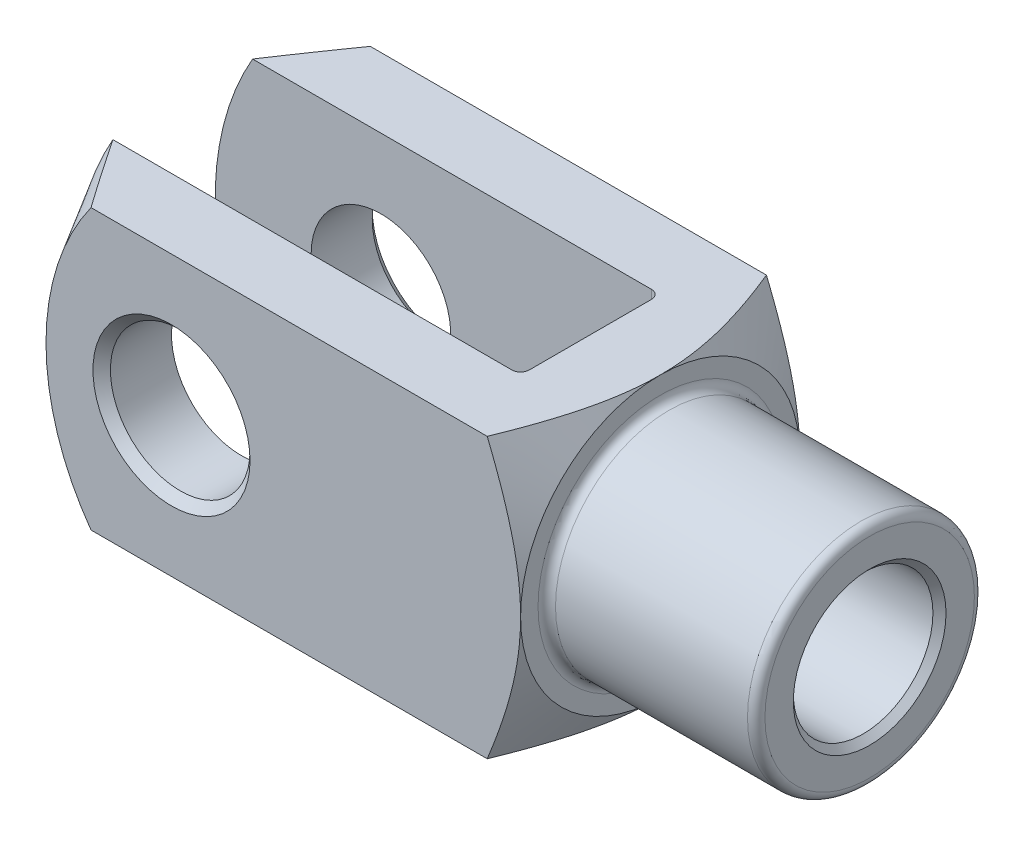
ISO-10303-21;
HEADER;
FILE_DESCRIPTION(('STEP AP214'),'2;1');
FILE_NAME('part.step','',(''),(''),'','','');
FILE_SCHEMA(('AUTOMOTIVE_DESIGN { 1 0 10303 214 1 1 1 1 }'));
ENDSEC;
DATA;
#1=APPLICATION_CONTEXT('core data for automotive mechanical design processes');
#2=APPLICATION_PROTOCOL_DEFINITION('international standard','automotive_design',2000,#1);
#3=PRODUCT_CONTEXT('',#1,'mechanical');
#4=PRODUCT('Part','Part','',(#3));
#5=PRODUCT_RELATED_PRODUCT_CATEGORY('part','',(#4));
#6=PRODUCT_DEFINITION_FORMATION('','',#4);
#7=PRODUCT_DEFINITION_CONTEXT('part definition',#1,'design');
#8=PRODUCT_DEFINITION('design','',#6,#7);
#9=PRODUCT_DEFINITION_SHAPE('','',#8);
#10=(LENGTH_UNIT() NAMED_UNIT(*) SI_UNIT(.MILLI.,.METRE.));
#11=(NAMED_UNIT(*) PLANE_ANGLE_UNIT() SI_UNIT($,.RADIAN.));
#12=(NAMED_UNIT(*) SI_UNIT($,.STERADIAN.) SOLID_ANGLE_UNIT());
#13=UNCERTAINTY_MEASURE_WITH_UNIT(LENGTH_MEASURE(1.E-05),#10,'distance_accuracy_value','');
#14=(GEOMETRIC_REPRESENTATION_CONTEXT(3) GLOBAL_UNCERTAINTY_ASSIGNED_CONTEXT((#13)) GLOBAL_UNIT_ASSIGNED_CONTEXT((#10,
#11,#12)) REPRESENTATION_CONTEXT('',''));
#15=CARTESIAN_POINT('',(0.,0.,0.));
#16=DIRECTION('',(0.,0.,1.));
#17=DIRECTION('',(1.,0.,0.));
#18=AXIS2_PLACEMENT_3D('',#15,#16,#17);
#19=CARTESIAN_POINT('',(-33.,-16.,-6.99999999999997));
#20=DIRECTION('',(0.,-1.,0.));
#21=DIRECTION('',(0.,0.,-1.));
#22=AXIS2_PLACEMENT_3D('',#19,#20,#21);
#23=CYLINDRICAL_SURFACE('',#22,1.);
#24=DIRECTION('',(0.,1.,0.));
#25=VECTOR('',#24,1.);
#26=CARTESIAN_POINT('',(-32.,-16.,-6.99999999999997));
#27=LINE('',#26,#25);
#28=CARTESIAN_POINT('',(-32.,-3.87298334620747,-6.99999999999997));
#29=VERTEX_POINT('',#28);
#30=CARTESIAN_POINT('',(-32.,-16.,-6.99999999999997));
#31=VERTEX_POINT('',#30);
#32=EDGE_CURVE('E358',#29,#31,#27,.F.);
#33=ORIENTED_EDGE('',*,*,#32,.F.);
#34=CARTESIAN_POINT('',(-32.,-3.87298334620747,-6.99999999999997));
#35=CARTESIAN_POINT('',(-32.0000090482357,-3.81506111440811,-7.03204875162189));
#36=CARTESIAN_POINT('',(-32.0015394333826,-3.75675902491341,-7.06336585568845));
#37=CARTESIAN_POINT('',(-32.00730166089,-3.63952511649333,-7.12448038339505));
#38=CARTESIAN_POINT('',(-32.0115323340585,-3.58059358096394,-7.15427845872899));
#39=CARTESIAN_POINT('',(-32.0277410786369,-3.40324230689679,-7.24121872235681));
#40=CARTESIAN_POINT('',(-32.0432390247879,-3.28400247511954,-7.29605254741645));
#41=CARTESIAN_POINT('',(-32.081478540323,-3.04456972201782,-7.39915667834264));
#42=CARTESIAN_POINT('',(-32.1041870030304,-2.92438355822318,-7.44745557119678));
#43=CARTESIAN_POINT('',(-32.1553570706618,-2.68282861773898,-7.53784294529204));
#44=CARTESIAN_POINT('',(-32.1838229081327,-2.56145903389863,-7.57992681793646));
#45=CARTESIAN_POINT('',(-32.2648278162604,-2.24038507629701,-7.68273685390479));
#46=CARTESIAN_POINT('',(-32.3211617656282,-2.03996193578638,-7.73829278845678));
#47=CARTESIAN_POINT('',(-32.441850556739,-1.63779800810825,-7.83328651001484));
#48=CARTESIAN_POINT('',(-32.5062087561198,-1.43605670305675,-7.87271752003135));
#49=CARTESIAN_POINT('',(-32.7067987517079,-0.829293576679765,-7.96742194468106));
#50=CARTESIAN_POINT('',(-32.8505643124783,-0.422667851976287,-7.99912712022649));
#51=CARTESIAN_POINT('',(-32.9960248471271,-0.0112434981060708,-7.99999406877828));
#52=CARTESIAN_POINT('',(-32.9980124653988,-0.00562166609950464,-7.99999999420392));
#53=CARTESIAN_POINT('',(-33.,0.,-7.99999999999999));
#54=B_SPLINE_CURVE_WITH_KNOTS('',3,(#34,#35,#36,#37,#38,#39,#40,#41,#42,#43,#44,#45,#46,#47,#48,
#49,#50,#51,#52,#53),.UNSPECIFIED.,.F.,.F.,(4,2,2,2,2,2,2,2,2,4),(0.,0.198535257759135,
0.396984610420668,0.792983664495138,1.18719018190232,1.58168756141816,2.22713013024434,
2.87284368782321,4.16406208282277,4.18195063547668),.UNSPECIFIED.);
#55=CARTESIAN_POINT('',(-33.,0.,-7.99999999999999));
#56=VERTEX_POINT('',#55);
#57=EDGE_CURVE('E390',#29,#56,#54,.T.);
#58=ORIENTED_EDGE('',*,*,#57,.T.);
#59=DIRECTION('',(0.,1.,0.));
#60=VECTOR('',#59,1.);
#61=CARTESIAN_POINT('',(-33.,16.,-7.99999999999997));
#62=LINE('',#61,#60);
#63=CARTESIAN_POINT('',(-33.,-16.,-7.99999999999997));
#64=VERTEX_POINT('',#63);
#65=EDGE_CURVE('E183',#64,#56,#62,.T.);
#66=ORIENTED_EDGE('',*,*,#65,.F.);
#67=CARTESIAN_POINT('',(-33.,-16.,-6.99999999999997));
#68=DIRECTION('',(0.,-1.,0.));
#69=DIRECTION('',(0.,0.,-1.));
#70=AXIS2_PLACEMENT_3D('',#67,#68,#69);
#71=CIRCLE('',#70,1.);
#72=EDGE_CURVE('E198',#31,#64,#71,.F.);
#73=ORIENTED_EDGE('',*,*,#72,.F.);
#74=EDGE_LOOP('',(#33,#58,#66,#73));
#75=FACE_BOUND('',#74,.T.);
#76=ADVANCED_FACE('F37',(#75),#23,.F.);
#77=CARTESIAN_POINT('',(-32.,-16.,-7.99999999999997));
#78=DIRECTION('',(1.,0.,0.));
#79=DIRECTION('',(0.,0.,-1.));
#80=AXIS2_PLACEMENT_3D('',#77,#78,#79);
#81=PLANE('',#80);
#82=CARTESIAN_POINT('',(-32.,16.,-6.99999999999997));
#83=VERTEX_POINT('',#82);
#84=CARTESIAN_POINT('',(-32.,3.87298334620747,-6.99999999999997));
#85=VERTEX_POINT('',#84);
#86=EDGE_CURVE('E374',#83,#85,#27,.F.);
#87=ORIENTED_EDGE('',*,*,#86,.T.);
#88=CARTESIAN_POINT('',(-32.,0.,0.));
#89=DIRECTION('',(1.,0.,0.));
#90=DIRECTION('',(0.,0.,-1.));
#91=AXIS2_PLACEMENT_3D('',#88,#89,#90);
#92=CIRCLE('',#91,8.);
#93=CARTESIAN_POINT('',(-32.,3.87298334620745,6.99999999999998));
#94=VERTEX_POINT('',#93);
#95=EDGE_CURVE('E439',#85,#94,#92,.T.);
#96=ORIENTED_EDGE('',*,*,#95,.T.);
#97=DIRECTION('',(0.,1.,0.));
#98=VECTOR('',#97,1.);
#99=CARTESIAN_POINT('',(-32.,16.,6.99999999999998));
#100=LINE('',#99,#98);
#101=CARTESIAN_POINT('',(-32.,16.,6.99999999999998));
#102=VERTEX_POINT('',#101);
#103=EDGE_CURVE('E160',#94,#102,#100,.T.);
#104=ORIENTED_EDGE('',*,*,#103,.T.);
#105=DIRECTION('',(0.,0.,-1.));
#106=VECTOR('',#105,1.);
#107=CARTESIAN_POINT('',(-32.,16.,-7.99999999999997));
#108=LINE('',#107,#106);
#109=EDGE_CURVE('E338',#102,#83,#108,.T.);
#110=ORIENTED_EDGE('',*,*,#109,.T.);
#111=EDGE_LOOP('',(#87,#96,#104,#110));
#112=FACE_BOUND('',#111,.T.);
#113=ADVANCED_FACE('F486',(#112),#81,.F.);
#114=CARTESIAN_POINT('',(-33.,-16.,6.99999999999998));
#115=DIRECTION('',(0.,-1.,0.));
#116=DIRECTION('',(0.,0.,-1.));
#117=AXIS2_PLACEMENT_3D('',#114,#115,#116);
#118=CYLINDRICAL_SURFACE('',#117,1.);
#119=ORIENTED_EDGE('',*,*,#103,.F.);
#120=CARTESIAN_POINT('',(-32.,3.87298334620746,6.99999999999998));
#121=CARTESIAN_POINT('',(-32.0000090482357,3.81506111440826,7.0320487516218));
#122=CARTESIAN_POINT('',(-32.0015394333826,3.75675902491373,7.06336585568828));
#123=CARTESIAN_POINT('',(-32.00730166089,3.63952511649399,7.12448038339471));
#124=CARTESIAN_POINT('',(-32.0115323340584,3.58059358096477,7.15427845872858));
#125=CARTESIAN_POINT('',(-32.0277410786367,3.40324230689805,7.24121872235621));
#126=CARTESIAN_POINT('',(-32.0432390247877,3.28400247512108,7.29605254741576));
#127=CARTESIAN_POINT('',(-32.0814785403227,3.0445697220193,7.39915667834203));
#128=CARTESIAN_POINT('',(-32.1041870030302,2.92438355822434,7.44745557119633));
#129=CARTESIAN_POINT('',(-32.1553570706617,2.68282861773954,7.53784294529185));
#130=CARTESIAN_POINT('',(-32.1838229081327,2.56145903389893,7.57992681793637));
#131=CARTESIAN_POINT('',(-32.2648278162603,2.24038507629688,7.68273685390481));
#132=CARTESIAN_POINT('',(-32.3211617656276,2.03996193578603,7.73829278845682));
#133=CARTESIAN_POINT('',(-32.4418505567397,1.63779800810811,7.83328651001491));
#134=CARTESIAN_POINT('',(-32.5062087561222,1.43605670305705,7.87271752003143));
#135=CARTESIAN_POINT('',(-32.7067987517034,0.829293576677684,7.96742194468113));
#136=CARTESIAN_POINT('',(-32.8505643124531,0.422667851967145,7.99912712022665));
#137=CARTESIAN_POINT('',(-32.9960248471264,0.0112434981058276,7.99999406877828));
#138=CARTESIAN_POINT('',(-32.9980124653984,0.00562166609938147,7.99999999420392));
#139=CARTESIAN_POINT('',(-33.,0.,7.99999999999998));
#140=B_SPLINE_CURVE_WITH_KNOTS('',3,(#120,#121,#122,#123,#124,#125,#126,#127,#128,#129,#130,
#131,#132,#133,#134,#135,#136,#137,#138,#139),.UNSPECIFIED.,.F.,.F.,(4,2,2,2,2,2,2,2,2,4),(0.,
0.198535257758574,0.396984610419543,0.792983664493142,1.18719018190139,1.58168756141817,
2.22713013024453,2.87284368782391,4.16406208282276,4.18195063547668),.UNSPECIFIED.);
#141=CARTESIAN_POINT('',(-33.,0.,7.99999999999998));
#142=VERTEX_POINT('',#141);
#143=EDGE_CURVE('E145',#94,#142,#140,.T.);
#144=ORIENTED_EDGE('',*,*,#143,.T.);
#145=DIRECTION('',(0.,1.,0.));
#146=VECTOR('',#145,1.);
#147=CARTESIAN_POINT('',(-33.,-16.,7.99999999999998));
#148=LINE('',#147,#146);
#149=CARTESIAN_POINT('',(-33.,16.,7.99999999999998));
#150=VERTEX_POINT('',#149);
#151=EDGE_CURVE('E159',#150,#142,#148,.F.);
#152=ORIENTED_EDGE('',*,*,#151,.F.);
#153=CARTESIAN_POINT('',(-33.,16.,6.99999999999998));
#154=DIRECTION('',(0.,1.,0.));
#155=DIRECTION('',(0.,0.,1.));
#156=AXIS2_PLACEMENT_3D('',#153,#154,#155);
#157=CIRCLE('',#156,1.);
#158=EDGE_CURVE('E190',#102,#150,#157,.F.);
#159=ORIENTED_EDGE('',*,*,#158,.F.);
#160=EDGE_LOOP('',(#119,#144,#152,#159));
#161=FACE_BOUND('',#160,.T.);
#162=ADVANCED_FACE('F156',(#161),#118,.F.);
#163=CARTESIAN_POINT('',(-83.,-16.,-7.99999999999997));
#164=DIRECTION('',(0.,0.,-1.));
#165=DIRECTION('',(-1.,0.,0.));
#166=AXIS2_PLACEMENT_3D('',#163,#164,#165);
#167=PLANE('',#166);
#168=CARTESIAN_POINT('',(-64.,0.,-7.99999999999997));
#169=DIRECTION('',(0.,0.,-1.));
#170=DIRECTION('',(-1.,0.,0.));
#171=AXIS2_PLACEMENT_3D('',#168,#169,#170);
#172=CIRCLE('',#171,8.);
#173=CARTESIAN_POINT('',(-72.,0.,-7.99999999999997));
#174=VERTEX_POINT('',#173);
#175=EDGE_CURVE('E368',#174,#174,#172,.F.);
#176=ORIENTED_EDGE('',*,*,#175,.F.);
#177=EDGE_LOOP('',(#176));
#178=FACE_BOUND('',#177,.T.);
#179=CARTESIAN_POINT('',(-51.,0.,-7.99999999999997));
#180=DIRECTION('',(0.,0.,1.));
#181=DIRECTION('',(1.,0.,0.));
#182=AXIS2_PLACEMENT_3D('',#179,#180,#181);
#183=CIRCLE('',#182,32.);
#184=CARTESIAN_POINT('',(-78.712812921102,16.,-7.99999999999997));
#185=VERTEX_POINT('',#184);
#186=CARTESIAN_POINT('',(-78.712812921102,-16.,-7.99999999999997));
#187=VERTEX_POINT('',#186);
#188=EDGE_CURVE('E276',#185,#187,#183,.T.);
#189=ORIENTED_EDGE('',*,*,#188,.T.);
#190=DIRECTION('',(-1.,0.,0.));
#191=VECTOR('',#190,1.);
#192=CARTESIAN_POINT('',(-83.,-16.,-7.99999999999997));
#193=LINE('',#192,#191);
#194=EDGE_CURVE('E333',#64,#187,#193,.T.);
#195=ORIENTED_EDGE('',*,*,#194,.F.);
#196=ORIENTED_EDGE('',*,*,#65,.T.);
#197=CARTESIAN_POINT('',(-33.,16.,-7.99999999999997));
#198=VERTEX_POINT('',#197);
#199=EDGE_CURVE('E179',#56,#198,#62,.T.);
#200=ORIENTED_EDGE('',*,*,#199,.T.);
#201=DIRECTION('',(-1.,0.,0.));
#202=VECTOR('',#201,1.);
#203=CARTESIAN_POINT('',(-83.,16.,-7.99999999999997));
#204=LINE('',#203,#202);
#205=EDGE_CURVE('E346',#198,#185,#204,.T.);
#206=ORIENTED_EDGE('',*,*,#205,.T.);
#207=EDGE_LOOP('',(#189,#195,#196,#200,#206));
#208=FACE_BOUND('',#207,.T.);
#209=ADVANCED_FACE('F393',(#178,#208),#167,.F.);
#210=CARTESIAN_POINT('',(-83.,-16.,7.99999999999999));
#211=DIRECTION('',(0.,0.,1.));
#212=DIRECTION('',(1.,0.,0.));
#213=AXIS2_PLACEMENT_3D('',#210,#211,#212);
#214=PLANE('',#213);
#215=CARTESIAN_POINT('',(-64.,0.,7.99999999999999));
#216=DIRECTION('',(0.,0.,1.));
#217=DIRECTION('',(1.,0.,0.));
#218=AXIS2_PLACEMENT_3D('',#215,#216,#217);
#219=CIRCLE('',#218,8.);
#220=CARTESIAN_POINT('',(-56.,0.,7.99999999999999));
#221=VERTEX_POINT('',#220);
#222=EDGE_CURVE('E345',#221,#221,#219,.F.);
#223=ORIENTED_EDGE('',*,*,#222,.F.);
#224=EDGE_LOOP('',(#223));
#225=FACE_BOUND('',#224,.T.);
#226=DIRECTION('',(1.,0.,0.));
#227=VECTOR('',#226,1.);
#228=CARTESIAN_POINT('',(-83.,-16.,7.99999999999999));
#229=LINE('',#228,#227);
#230=CARTESIAN_POINT('',(-78.712812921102,-16.,7.99999999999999));
#231=VERTEX_POINT('',#230);
#232=CARTESIAN_POINT('',(-33.,-16.,7.99999999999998));
#233=VERTEX_POINT('',#232);
#234=EDGE_CURVE('E337',#231,#233,#229,.T.);
#235=ORIENTED_EDGE('',*,*,#234,.F.);
#236=CARTESIAN_POINT('',(-51.,0.,7.99999999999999));
#237=DIRECTION('',(0.,0.,1.));
#238=DIRECTION('',(1.,0.,0.));
#239=AXIS2_PLACEMENT_3D('',#236,#237,#238);
#240=CIRCLE('',#239,32.);
#241=CARTESIAN_POINT('',(-78.712812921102,16.,7.99999999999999));
#242=VERTEX_POINT('',#241);
#243=EDGE_CURVE('E751',#242,#231,#240,.T.);
#244=ORIENTED_EDGE('',*,*,#243,.F.);
#245=DIRECTION('',(1.,0.,0.));
#246=VECTOR('',#245,1.);
#247=CARTESIAN_POINT('',(-83.,16.,7.99999999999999));
#248=LINE('',#247,#246);
#249=EDGE_CURVE('E176',#242,#150,#248,.T.);
#250=ORIENTED_EDGE('',*,*,#249,.T.);
#251=ORIENTED_EDGE('',*,*,#151,.T.);
#252=EDGE_CURVE('E164',#142,#233,#148,.F.);
#253=ORIENTED_EDGE('',*,*,#252,.T.);
#254=EDGE_LOOP('',(#235,#244,#250,#251,#253));
#255=FACE_BOUND('',#254,.T.);
#256=ADVANCED_FACE('F173',(#225,#255),#214,.F.);
#257=CARTESIAN_POINT('',(-83.,-16.,16.));
#258=DIRECTION('',(0.,0.,1.));
#259=DIRECTION('',(1.,0.,0.));
#260=AXIS2_PLACEMENT_3D('',#257,#258,#259);
#261=PLANE('',#260);
#262=CARTESIAN_POINT('',(-64.,0.,16.));
#263=DIRECTION('',(0.,0.,1.));
#264=DIRECTION('',(1.,0.,0.));
#265=AXIS2_PLACEMENT_3D('',#262,#263,#264);
#266=CIRCLE('',#265,8.99999999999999);
#267=CARTESIAN_POINT('',(-55.,0.,16.));
#268=VERTEX_POINT('',#267);
#269=EDGE_CURVE('E228',#268,#268,#266,.F.);
#270=ORIENTED_EDGE('',*,*,#269,.T.);
#271=EDGE_LOOP('',(#270));
#272=FACE_BOUND('',#271,.T.);
#273=DIRECTION('',(1.,0.,0.));
#274=VECTOR('',#273,1.);
#275=CARTESIAN_POINT('',(-83.,16.,16.));
#276=LINE('',#275,#274);
#277=CARTESIAN_POINT('',(-73.2200359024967,16.,16.));
#278=VERTEX_POINT('',#277);
#279=CARTESIAN_POINT('',(-27.8263409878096,16.,16.));
#280=VERTEX_POINT('',#279);
#281=EDGE_CURVE('E365',#278,#280,#276,.T.);
#282=ORIENTED_EDGE('',*,*,#281,.F.);
#283=CARTESIAN_POINT('',(-51.,0.,16.));
#284=DIRECTION('',(0.,0.,1.));
#285=DIRECTION('',(1.,0.,0.));
#286=AXIS2_PLACEMENT_3D('',#283,#284,#285);
#287=CIRCLE('',#286,27.381197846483);
#288=CARTESIAN_POINT('',(-73.2200359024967,-16.,16.));
#289=VERTEX_POINT('',#288);
#290=EDGE_CURVE('E61',#278,#289,#287,.T.);
#291=ORIENTED_EDGE('',*,*,#290,.T.);
#292=DIRECTION('',(1.,0.,0.));
#293=VECTOR('',#292,1.);
#294=CARTESIAN_POINT('',(-83.,-16.,16.));
#295=LINE('',#294,#293);
#296=CARTESIAN_POINT('',(-27.8263409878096,-16.,16.));
#297=VERTEX_POINT('',#296);
#298=EDGE_CURVE('E362',#289,#297,#295,.T.);
#299=ORIENTED_EDGE('',*,*,#298,.T.);
#300=CARTESIAN_POINT('',(-35.7693975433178,-32.6784696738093,16.));
#301=CARTESIAN_POINT('',(-35.5649534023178,-32.2841914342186,16.));
#302=CARTESIAN_POINT('',(-35.3610695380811,-31.8896227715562,16.));
#303=CARTESIAN_POINT('',(-34.9545422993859,-31.0998453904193,16.));
#304=CARTESIAN_POINT('',(-34.7518989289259,-30.7046366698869,16.));
#305=CARTESIAN_POINT('',(-34.1459910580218,-29.5179255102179,16.));
#306=CARTESIAN_POINT('',(-33.7447694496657,-28.725377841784,16.));
#307=CARTESIAN_POINT('',(-32.948304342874,-27.1355535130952,16.));
#308=CARTESIAN_POINT('',(-32.5530724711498,-26.3382710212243,16.));
#309=CARTESIAN_POINT('',(-31.7709229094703,-24.7396478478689,16.));
#310=CARTESIAN_POINT('',(-31.3840050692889,-23.9383072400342,16.));
#311=CARTESIAN_POINT('',(-30.5971278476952,-22.2812030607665,16.));
#312=CARTESIAN_POINT('',(-30.1978306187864,-21.4251243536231,16.));
#313=CARTESIAN_POINT('',(-29.4144189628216,-19.7059517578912,16.));
#314=CARTESIAN_POINT('',(-29.030305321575,-18.8428575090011,16.));
#315=CARTESIAN_POINT('',(-28.469277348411,-17.5419055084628,16.));
#316=CARTESIAN_POINT('',(-28.2848287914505,-17.1072946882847,16.));
#317=CARTESIAN_POINT('',(-27.9217435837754,-16.2356552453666,16.));
#318=CARTESIAN_POINT('',(-27.7431068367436,-15.7986266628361,16.));
#319=CARTESIAN_POINT('',(-27.3925648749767,-14.9219132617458,16.));
#320=CARTESIAN_POINT('',(-27.2206591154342,-14.4822286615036,16.));
#321=CARTESIAN_POINT('',(-26.8846508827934,-13.5998952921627,16.));
#322=CARTESIAN_POINT('',(-26.7205482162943,-13.15724659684,16.));
#323=CARTESIAN_POINT('',(-26.3667959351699,-12.1723292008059,16.));
#324=CARTESIAN_POINT('',(-26.1793236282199,-11.6292738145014,16.));
#325=CARTESIAN_POINT('',(-25.8205117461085,-10.5378822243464,16.));
#326=CARTESIAN_POINT('',(-25.6491707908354,-9.98954647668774,16.));
#327=CARTESIAN_POINT('',(-25.3258019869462,-8.88718113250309,16.));
#328=CARTESIAN_POINT('',(-25.1737737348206,-8.33315165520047,16.));
#329=CARTESIAN_POINT('',(-24.892661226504,-7.21925530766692,16.));
#330=CARTESIAN_POINT('',(-24.763576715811,-6.65938850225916,16.));
#331=CARTESIAN_POINT('',(-24.5349588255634,-5.54729135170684,16.));
#332=CARTESIAN_POINT('',(-24.4348028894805,-4.99519025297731,16.));
#333=CARTESIAN_POINT('',(-24.2636126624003,-3.88645323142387,16.));
#334=CARTESIAN_POINT('',(-24.1925774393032,-3.32981745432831,16.));
#335=CARTESIAN_POINT('',(-24.0825979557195,-2.2137104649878,16.));
#336=CARTESIAN_POINT('',(-24.0436327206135,-1.65424134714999,16.));
#337=CARTESIAN_POINT('',(-23.9995121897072,-0.533966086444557,16.));
#338=CARTESIAN_POINT('',(-23.9943557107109,0.0268400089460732,16.));
#339=CARTESIAN_POINT('',(-24.0172205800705,1.106864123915,16.));
#340=CARTESIAN_POINT('',(-24.0428517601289,1.62613491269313,16.));
#341=CARTESIAN_POINT('',(-24.1223285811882,2.66248971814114,16.));
#342=CARTESIAN_POINT('',(-24.1761741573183,3.17957373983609,16.));
#343=CARTESIAN_POINT('',(-24.3101058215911,4.21056490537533,16.));
#344=CARTESIAN_POINT('',(-24.3902054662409,4.72447026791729,16.));
#345=CARTESIAN_POINT('',(-24.5740043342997,5.74801582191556,16.));
#346=CARTESIAN_POINT('',(-24.6777042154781,6.25765589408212,16.));
#347=CARTESIAN_POINT('',(-24.909120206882,7.2869259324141,16.));
#348=CARTESIAN_POINT('',(-25.0374445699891,7.80641809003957,16.));
#349=CARTESIAN_POINT('',(-25.3129308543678,8.84034891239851,16.));
#350=CARTESIAN_POINT('',(-25.4600929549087,9.35478752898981,16.));
#351=CARTESIAN_POINT('',(-25.7704071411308,10.3787720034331,16.));
#352=CARTESIAN_POINT('',(-25.9335585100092,10.8883180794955,16.));
#353=CARTESIAN_POINT('',(-26.1884088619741,11.6492037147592,16.));
#354=CARTESIAN_POINT('',(-26.2750447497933,11.9022560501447,16.));
#355=CARTESIAN_POINT('',(-26.4514227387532,12.4072754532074,16.));
#356=CARTESIAN_POINT('',(-26.5411648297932,12.6592425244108,16.));
#357=CARTESIAN_POINT('',(-26.8295171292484,13.454575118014,16.));
#358=CARTESIAN_POINT('',(-27.0333628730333,13.9960468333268,16.));
#359=CARTESIAN_POINT('',(-27.4521222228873,15.0747063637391,16.));
#360=CARTESIAN_POINT('',(-27.6670364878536,15.6118939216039,16.));
#361=CARTESIAN_POINT('',(-28.1061456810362,16.6825956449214,16.));
#362=CARTESIAN_POINT('',(-28.3303426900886,17.2161089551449,16.));
#363=CARTESIAN_POINT('',(-28.786473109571,18.2797983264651,16.));
#364=CARTESIAN_POINT('',(-29.0184063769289,18.8099744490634,16.));
#365=CARTESIAN_POINT('',(-29.4890009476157,19.8678755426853,16.));
#366=CARTESIAN_POINT('',(-29.727667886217,20.3955980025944,16.));
#367=CARTESIAN_POINT('',(-30.2105443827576,21.448499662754,16.));
#368=CARTESIAN_POINT('',(-30.4547539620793,21.9736788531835,16.));
#369=CARTESIAN_POINT('',(-30.9478700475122,23.0217502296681,16.));
#370=CARTESIAN_POINT('',(-31.1967760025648,23.5446426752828,16.));
#371=CARTESIAN_POINT('',(-31.6986473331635,24.5884772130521,16.));
#372=CARTESIAN_POINT('',(-31.9516127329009,25.1094192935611,16.));
#373=CARTESIAN_POINT('',(-32.7172875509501,26.6728451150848,16.));
#374=CARTESIAN_POINT('',(-33.2352702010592,27.7127471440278,16.));
#375=CARTESIAN_POINT('',(-34.2818275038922,29.7872182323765,16.));
#376=CARTESIAN_POINT('',(-34.8104023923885,30.8217871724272,16.));
#377=CARTESIAN_POINT('',(-35.8754784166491,32.8861860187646,16.));
#378=CARTESIAN_POINT('',(-36.4119755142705,33.916018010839,16.));
#379=CARTESIAN_POINT('',(-37.4913991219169,35.9722925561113,16.));
#380=CARTESIAN_POINT('',(-38.0343255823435,36.9987351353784,16.));
#381=CARTESIAN_POINT('',(-39.0443143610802,38.8966473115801,16.));
#382=CARTESIAN_POINT('',(-39.5106690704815,39.768493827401,16.));
#383=CARTESIAN_POINT('',(-40.446506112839,41.5105071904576,16.));
#384=CARTESIAN_POINT('',(-40.9159884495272,42.3806740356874,16.));
#385=CARTESIAN_POINT('',(-42.3285002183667,44.9892873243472,16.));
#386=CARTESIAN_POINT('',(-43.2754644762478,46.7256030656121,16.));
#387=CARTESIAN_POINT('',(-45.1715733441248,50.1841146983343,16.));
#388=CARTESIAN_POINT('',(-46.120674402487,51.9063345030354,16.));
#389=CARTESIAN_POINT('',(-47.5485244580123,54.4871624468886,16.));
#390=CARTESIAN_POINT('',(-48.0251365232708,55.346953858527,16.));
#391=CARTESIAN_POINT('',(-48.979616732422,57.0658379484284,16.));
#392=CARTESIAN_POINT('',(-49.4574848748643,57.9249306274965,16.));
#393=CARTESIAN_POINT('',(-49.9358976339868,58.7837198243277,16.));
#394=B_SPLINE_CURVE_WITH_KNOTS('',3,(#300,#301,#302,#303,#304,#305,#306,#307,#308,#309,#310,
#311,#312,#313,#314,#315,#316,#317,#318,#319,#320,#321,#322,#323,#324,#325,#326,#327,#328,#329,
#330,#331,#332,#333,#334,#335,#336,#337,#338,#339,#340,#341,#342,#343,#344,#345,#346,#347,#348,
#349,#350,#351,#352,#353,#354,#355,#356,#357,#358,#359,#360,#361,#362,#363,#364,#365,#366,#367,
#368,#369,#370,#371,#372,#373,#374,#375,#376,#377,#378,#379,#380,#381,#382,#383,#384,#385,#386,
#387,#388,#389,#390,#391,#392,#393),.UNSPECIFIED.,.F.,.F.,(4,2,2,2,2,2,2,2,2,2,2,2,2,2,2,2,2,2,
2,2,2,2,2,2,2,2,2,2,2,2,2,2,2,2,2,2,2,2,2,2,2,2,2,2,2,2,4),(0.,1.33239347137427,
2.66479123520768,5.32972119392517,7.99929176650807,10.6688140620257,13.5025727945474,
16.3364779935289,17.7528378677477,19.1691742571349,20.5853957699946,22.0015821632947,
23.7248813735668,25.4480330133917,27.1711486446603,28.8942451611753,30.5768935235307,
32.2594880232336,33.9409811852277,35.6224155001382,37.1813298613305,38.7402406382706,
40.2999576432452,41.8597181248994,43.4646245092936,45.0695461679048,46.6743959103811,
47.4767954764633,48.2791924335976,50.0147426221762,51.7503962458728,53.4864410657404,
55.2224537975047,56.95996517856,58.6974832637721,60.4347987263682,62.1721245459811,
65.6573336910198,69.1426204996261,72.626188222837,76.1097290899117,79.0759362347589,
82.0421469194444,87.9753961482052,93.8746630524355,96.8238320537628,99.772997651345),.UNSPECIFIED.);
#395=CARTESIAN_POINT('',(-24.,0.,16.));
#396=VERTEX_POINT('',#395);
#397=EDGE_CURVE('E305',#396,#297,#394,.F.);
#398=ORIENTED_EDGE('',*,*,#397,.F.);
#399=EDGE_CURVE('E303',#280,#396,#394,.F.);
#400=ORIENTED_EDGE('',*,*,#399,.F.);
#401=EDGE_LOOP('',(#282,#291,#299,#398,#400));
#402=FACE_BOUND('',#401,.T.);
#403=ADVANCED_FACE('F287',(#272,#402),#261,.T.);
#404=CARTESIAN_POINT('',(-83.,-16.,16.));
#405=DIRECTION('',(0.,-1.,0.));
#406=DIRECTION('',(0.,0.,-1.));
#407=AXIS2_PLACEMENT_3D('',#404,#405,#406);
#408=PLANE('',#407);
#409=ORIENTED_EDGE('',*,*,#194,.T.);
#410=CARTESIAN_POINT('',(-91.3714292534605,-16.,11.7911070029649));
#411=CARTESIAN_POINT('',(-90.5929450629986,-16.,10.5376757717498));
#412=CARTESIAN_POINT('',(-89.8123280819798,-16.,9.28556385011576));
#413=CARTESIAN_POINT('',(-88.2458326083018,-16.,6.78460141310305));
#414=CARTESIAN_POINT('',(-87.4599540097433,-16.,5.53575096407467));
#415=CARTESIAN_POINT('',(-85.881028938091,-16.,3.04049656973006));
#416=CARTESIAN_POINT('',(-85.0879750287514,-16.,1.7940973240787));
#417=CARTESIAN_POINT('',(-83.8927062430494,-16.,-0.0718476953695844));
#418=CARTESIAN_POINT('',(-83.4933374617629,-16.,-0.693217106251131));
#419=CARTESIAN_POINT('',(-82.6924903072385,-16.,-1.93460096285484));
#420=CARTESIAN_POINT('',(-82.2910119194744,-16.,-2.55461539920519));
#421=CARTESIAN_POINT('',(-81.0495570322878,-16.,-4.46394316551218));
#422=CARTESIAN_POINT('',(-80.2056856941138,-16.,-5.7507287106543));
#423=CARTESIAN_POINT('',(-78.5052163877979,-16.,-8.31586424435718));
#424=CARTESIAN_POINT('',(-77.6486185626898,-16.,-9.59421432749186));
#425=CARTESIAN_POINT('',(-76.3516969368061,-16.,-11.5028868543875));
#426=CARTESIAN_POINT('',(-75.9175465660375,-16.,-12.1374051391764));
#427=CARTESIAN_POINT('',(-75.0445181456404,-16.,-13.4031790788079));
#428=CARTESIAN_POINT('',(-74.605640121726,-16.,-14.0344347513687));
#429=CARTESIAN_POINT('',(-73.7224503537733,-16.,-15.2930972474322));
#430=CARTESIAN_POINT('',(-73.2781388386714,-16.,-15.9205042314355));
#431=CARTESIAN_POINT('',(-72.3831787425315,-16.,-17.1707775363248));
#432=CARTESIAN_POINT('',(-71.9325302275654,-16.,-17.7936439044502));
#433=CARTESIAN_POINT('',(-71.028029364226,-16.,-19.0281553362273));
#434=CARTESIAN_POINT('',(-70.5742460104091,-16.,-19.6398508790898));
#435=CARTESIAN_POINT('',(-69.6580392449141,-16.,-20.8567662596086));
#436=CARTESIAN_POINT('',(-69.1956156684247,-16.,-21.4619859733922));
#437=CARTESIAN_POINT('',(-68.2598142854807,-16.,-22.6652514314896));
#438=CARTESIAN_POINT('',(-67.7864223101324,-16.,-23.2632861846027));
#439=CARTESIAN_POINT('',(-66.8271654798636,-16.,-24.4492371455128));
#440=CARTESIAN_POINT('',(-66.3413013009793,-16.,-25.0371538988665));
#441=CARTESIAN_POINT('',(-65.3593848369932,-16.,-26.1940459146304));
#442=CARTESIAN_POINT('',(-64.863490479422,-16.,-26.7631543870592));
#443=CARTESIAN_POINT('',(-64.1056619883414,-16.,-27.6043633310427));
#444=CARTESIAN_POINT('',(-63.8506801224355,-16.,-27.8827334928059));
#445=CARTESIAN_POINT('',(-63.3355101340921,-16.,-28.4346076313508));
#446=CARTESIAN_POINT('',(-63.075322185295,-16.,-28.708111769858));
#447=CARTESIAN_POINT('',(-62.5496746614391,-16.,-29.248862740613));
#448=CARTESIAN_POINT('',(-62.2842277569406,-16.,-29.5161218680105));
#449=CARTESIAN_POINT('',(-61.7468052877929,-16.,-30.0439769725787));
#450=CARTESIAN_POINT('',(-61.4748301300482,-16.,-30.3045733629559));
#451=CARTESIAN_POINT('',(-60.9236476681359,-16.,-30.8177372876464));
#452=CARTESIAN_POINT('',(-60.6444440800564,-16.,-31.070308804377));
#453=CARTESIAN_POINT('',(-60.0777664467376,-16.,-31.5659640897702));
#454=CARTESIAN_POINT('',(-59.7902936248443,-16.,-31.8090492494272));
#455=CARTESIAN_POINT('',(-59.3468920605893,-16.,-32.169292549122));
#456=CARTESIAN_POINT('',(-59.1943717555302,-16.,-32.2906537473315));
#457=CARTESIAN_POINT('',(-58.886676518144,-16.,-32.5299575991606));
#458=CARTESIAN_POINT('',(-58.7315016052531,-16.,-32.6479002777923));
#459=CARTESIAN_POINT('',(-58.2616904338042,-16.,-32.9961048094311));
#460=CARTESIAN_POINT('',(-57.9428096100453,-16.,-33.2207088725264));
#461=CARTESIAN_POINT('',(-57.2928256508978,-16.,-33.6509952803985));
#462=CARTESIAN_POINT('',(-56.9617323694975,-16.,-33.8566924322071));
#463=CARTESIAN_POINT('',(-56.2860892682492,-16.,-34.2447467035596));
#464=CARTESIAN_POINT('',(-55.9415429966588,-16.,-34.4271099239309));
#465=CARTESIAN_POINT('',(-55.3187542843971,-16.,-34.7245627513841));
#466=CARTESIAN_POINT('',(-55.0433165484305,-16.,-34.8455088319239));
#467=CARTESIAN_POINT('',(-54.4844448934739,-16.,-35.0671656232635));
#468=CARTESIAN_POINT('',(-54.2010136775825,-16.,-35.1678830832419));
#469=CARTESIAN_POINT('',(-53.6272287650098,-16.,-35.3459456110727));
#470=CARTESIAN_POINT('',(-53.3368843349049,-16.,-35.4233202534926));
#471=CARTESIAN_POINT('',(-52.7504269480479,-16.,-35.5520122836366));
#472=CARTESIAN_POINT('',(-52.4543142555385,-16.,-35.6033308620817));
#473=CARTESIAN_POINT('',(-51.8555360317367,-16.,-35.6780890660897));
#474=CARTESIAN_POINT('',(-51.5528345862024,-16.,-35.7012449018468));
#475=CARTESIAN_POINT('',(-50.94662565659,-16.,-35.7176301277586));
#476=CARTESIAN_POINT('',(-50.6431182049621,-16.,-35.7108607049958));
#477=CARTESIAN_POINT('',(-50.0381777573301,-16.,-35.66772256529));
#478=CARTESIAN_POINT('',(-49.7367451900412,-16.,-35.6313479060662));
#479=CARTESIAN_POINT('',(-49.138599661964,-16.,-35.5306731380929));
#480=CARTESIAN_POINT('',(-48.8418874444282,-16.,-35.4663686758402));
#481=CARTESIAN_POINT('',(-48.2008177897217,-16.,-35.2982030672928));
#482=CARTESIAN_POINT('',(-47.857810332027,-16.,-35.1892223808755));
#483=CARTESIAN_POINT('',(-47.1829198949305,-16.,-34.9408312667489));
#484=CARTESIAN_POINT('',(-46.8510432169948,-16.,-34.8014039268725));
#485=CARTESIAN_POINT('',(-46.3616955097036,-16.,-34.5731174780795));
#486=CARTESIAN_POINT('',(-46.1997313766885,-16.,-34.4936845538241));
#487=CARTESIAN_POINT('',(-45.8788299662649,-16.,-34.3290841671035));
#488=CARTESIAN_POINT('',(-45.7198913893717,-16.,-34.2439192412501));
#489=CARTESIAN_POINT('',(-45.2474402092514,-16.,-33.980610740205));
#490=CARTESIAN_POINT('',(-44.9382745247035,-16.,-33.7946450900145));
#491=CARTESIAN_POINT('',(-44.2312746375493,-16.,-33.3419896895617));
#492=CARTESIAN_POINT('',(-43.8376126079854,-16.,-33.0688272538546));
#493=CARTESIAN_POINT('',(-43.0671777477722,-16.,-32.4995062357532));
#494=CARTESIAN_POINT('',(-42.6904130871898,-16.,-32.2033367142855));
#495=CARTESIAN_POINT('',(-41.9509392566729,-16.,-31.5926380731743));
#496=CARTESIAN_POINT('',(-41.5882585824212,-16.,-31.2780746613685));
#497=CARTESIAN_POINT('',(-40.8756929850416,-16.,-30.6349635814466));
#498=CARTESIAN_POINT('',(-40.5258059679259,-16.,-30.3064182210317));
#499=CARTESIAN_POINT('',(-39.8346538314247,-16.,-29.6358722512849));
#500=CARTESIAN_POINT('',(-39.4934620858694,-16.,-29.2937963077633));
#501=CARTESIAN_POINT('',(-38.8205894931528,-16.,-28.6004219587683));
#502=CARTESIAN_POINT('',(-38.4889089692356,-16.,-28.2491232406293));
#503=CARTESIAN_POINT('',(-37.83411152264,-16.,-27.5393264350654));
#504=CARTESIAN_POINT('',(-37.510986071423,-16.,-27.1808361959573));
#505=CARTESIAN_POINT('',(-36.8718712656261,-16.,-26.457577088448));
#506=CARTESIAN_POINT('',(-36.5558817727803,-16.,-26.0928083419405));
#507=CARTESIAN_POINT('',(-35.8004695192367,-16.,-25.205745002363));
#508=CARTESIAN_POINT('',(-35.3641536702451,-16.,-24.6808057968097));
#509=CARTESIAN_POINT('',(-34.5017899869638,-16.,-23.6224177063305));
#510=CARTESIAN_POINT('',(-34.0757441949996,-16.,-23.0889671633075));
#511=CARTESIAN_POINT('',(-33.2388292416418,-16.,-22.0234541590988));
#512=CARTESIAN_POINT('',(-32.8278275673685,-16.,-21.4914956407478));
#513=CARTESIAN_POINT('',(-32.2167920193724,-16.,-20.6895302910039));
#514=CARTESIAN_POINT('',(-32.0140541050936,-16.,-20.4215769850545));
#515=CARTESIAN_POINT('',(-31.6102515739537,-16.,-19.8844163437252));
#516=CARTESIAN_POINT('',(-31.4091869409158,-16.,-19.6152090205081));
#517=CARTESIAN_POINT('',(-31.2088929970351,-16.,-19.3454290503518));
#518=B_SPLINE_CURVE_WITH_KNOTS('',3,(#410,#411,#412,#413,#414,#415,#416,#417,#418,#419,#420,
#421,#422,#423,#424,#425,#426,#427,#428,#429,#430,#431,#432,#433,#434,#435,#436,#437,#438,#439,
#440,#441,#442,#443,#444,#445,#446,#447,#448,#449,#450,#451,#452,#453,#454,#455,#456,#457,#458,
#459,#460,#461,#462,#463,#464,#465,#466,#467,#468,#469,#470,#471,#472,#473,#474,#475,#476,#477,
#478,#479,#480,#481,#482,#483,#484,#485,#486,#487,#488,#489,#490,#491,#492,#493,#494,#495,#496,
#497,#498,#499,#500,#501,#502,#503,#504,#505,#506,#507,#508,#509,#510,#511,#512,#513,#514,#515,
#516,#517),.UNSPECIFIED.,.F.,.F.,(4,2,2,2,2,2,2,2,2,2,2,2,2,2,2,2,2,2,2,2,2,2,2,2,2,2,2,2,2,2,2,
2,2,2,2,2,2,2,2,2,2,2,2,2,2,2,2,2,2,2,2,2,2,4),(0.,4.42653200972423,8.85315338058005,
13.2850586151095,15.5009877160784,17.7169320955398,22.3333045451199,26.9496251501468,
29.2560988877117,31.5625600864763,33.868924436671,36.1752647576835,38.4601118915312,
40.7450026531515,43.0330306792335,45.320934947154,47.5851104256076,48.7175544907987,
49.8499608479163,50.9799088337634,52.1097865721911,53.2390945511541,54.3682363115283,
54.9529313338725,55.5376220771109,56.707165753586,57.8757855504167,59.0440991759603,
59.9458947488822,60.8473889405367,61.7477361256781,62.6480421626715,63.5573471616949,
64.4666160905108,65.376067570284,66.2856608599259,67.3636659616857,68.4422713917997,
68.983357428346,69.5242055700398,70.605843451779,72.0422032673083,73.4792502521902,
74.9190675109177,76.3586480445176,77.807863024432,79.2571271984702,80.7048876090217,
82.1526199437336,84.2002258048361,86.2482355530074,88.2648689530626,89.2728889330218,
90.2808991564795),.UNSPECIFIED.);
#519=CARTESIAN_POINT('',(-73.2200359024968,-16.,-16.));
#520=VERTEX_POINT('',#519);
#521=EDGE_CURVE('E275',#187,#520,#518,.T.);
#522=ORIENTED_EDGE('',*,*,#521,.T.);
#523=DIRECTION('',(1.,0.,0.));
#524=VECTOR('',#523,1.);
#525=CARTESIAN_POINT('',(-83.,-16.,-16.));
#526=LINE('',#525,#524);
#527=CARTESIAN_POINT('',(-27.8263409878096,-16.,-16.));
#528=VERTEX_POINT('',#527);
#529=EDGE_CURVE('E359',#520,#528,#526,.T.);
#530=ORIENTED_EDGE('',*,*,#529,.T.);
#531=CARTESIAN_POINT('',(-35.7693975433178,-16.,-32.6784696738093));
#532=CARTESIAN_POINT('',(-35.5649534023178,-16.,-32.2841914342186));
#533=CARTESIAN_POINT('',(-35.3610695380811,-16.,-31.8896227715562));
#534=CARTESIAN_POINT('',(-34.9545422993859,-16.,-31.0998453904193));
#535=CARTESIAN_POINT('',(-34.7518989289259,-16.,-30.7046366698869));
#536=CARTESIAN_POINT('',(-34.1459910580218,-16.,-29.5179255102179));
#537=CARTESIAN_POINT('',(-33.7447694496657,-16.,-28.725377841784));
#538=CARTESIAN_POINT('',(-32.948304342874,-16.,-27.1355535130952));
#539=CARTESIAN_POINT('',(-32.5530724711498,-16.,-26.3382710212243));
#540=CARTESIAN_POINT('',(-31.7709229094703,-16.,-24.7396478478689));
#541=CARTESIAN_POINT('',(-31.3840050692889,-16.,-23.9383072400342));
#542=CARTESIAN_POINT('',(-30.5971278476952,-16.,-22.2812030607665));
#543=CARTESIAN_POINT('',(-30.1978306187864,-16.,-21.4251243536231));
#544=CARTESIAN_POINT('',(-29.4144189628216,-16.,-19.7059517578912));
#545=CARTESIAN_POINT('',(-29.030305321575,-16.,-18.8428575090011));
#546=CARTESIAN_POINT('',(-28.469277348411,-16.,-17.5419055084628));
#547=CARTESIAN_POINT('',(-28.2848287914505,-16.,-17.1072946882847));
#548=CARTESIAN_POINT('',(-27.9217435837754,-16.,-16.2356552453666));
#549=CARTESIAN_POINT('',(-27.7431068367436,-16.,-15.7986266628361));
#550=CARTESIAN_POINT('',(-27.3925648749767,-16.,-14.9219132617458));
#551=CARTESIAN_POINT('',(-27.2206591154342,-16.,-14.4822286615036));
#552=CARTESIAN_POINT('',(-26.8846508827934,-16.,-13.5998952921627));
#553=CARTESIAN_POINT('',(-26.7205482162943,-16.,-13.15724659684));
#554=CARTESIAN_POINT('',(-26.3667959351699,-16.,-12.1723292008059));
#555=CARTESIAN_POINT('',(-26.1793236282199,-16.,-11.6292738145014));
#556=CARTESIAN_POINT('',(-25.8205117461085,-16.,-10.5378822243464));
#557=CARTESIAN_POINT('',(-25.6491707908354,-16.,-9.98954647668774));
#558=CARTESIAN_POINT('',(-25.3258019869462,-16.,-8.88718113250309));
#559=CARTESIAN_POINT('',(-25.1737737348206,-16.,-8.33315165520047));
#560=CARTESIAN_POINT('',(-24.892661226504,-16.,-7.21925530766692));
#561=CARTESIAN_POINT('',(-24.763576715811,-16.,-6.65938850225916));
#562=CARTESIAN_POINT('',(-24.5349588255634,-16.,-5.54729135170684));
#563=CARTESIAN_POINT('',(-24.4348028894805,-16.,-4.99519025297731));
#564=CARTESIAN_POINT('',(-24.2636126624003,-16.,-3.88645323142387));
#565=CARTESIAN_POINT('',(-24.1925774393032,-16.,-3.32981745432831));
#566=CARTESIAN_POINT('',(-24.0825979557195,-16.,-2.2137104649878));
#567=CARTESIAN_POINT('',(-24.0436327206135,-16.,-1.65424134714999));
#568=CARTESIAN_POINT('',(-23.9995121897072,-16.,-0.533966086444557));
#569=CARTESIAN_POINT('',(-23.9943557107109,-16.,0.0268400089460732));
#570=CARTESIAN_POINT('',(-24.0172205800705,-16.,1.106864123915));
#571=CARTESIAN_POINT('',(-24.0428517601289,-16.,1.62613491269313));
#572=CARTESIAN_POINT('',(-24.1223285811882,-16.,2.66248971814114));
#573=CARTESIAN_POINT('',(-24.1761741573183,-16.,3.17957373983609));
#574=CARTESIAN_POINT('',(-24.3101058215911,-16.,4.21056490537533));
#575=CARTESIAN_POINT('',(-24.3902054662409,-16.,4.72447026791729));
#576=CARTESIAN_POINT('',(-24.5740043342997,-16.,5.74801582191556));
#577=CARTESIAN_POINT('',(-24.6777042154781,-16.,6.25765589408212));
#578=CARTESIAN_POINT('',(-24.909120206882,-16.,7.2869259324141));
#579=CARTESIAN_POINT('',(-25.0374445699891,-16.,7.80641809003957));
#580=CARTESIAN_POINT('',(-25.3129308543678,-16.,8.84034891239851));
#581=CARTESIAN_POINT('',(-25.4600929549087,-16.,9.35478752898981));
#582=CARTESIAN_POINT('',(-25.7704071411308,-16.,10.3787720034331));
#583=CARTESIAN_POINT('',(-25.9335585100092,-16.,10.8883180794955));
#584=CARTESIAN_POINT('',(-26.1884088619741,-16.,11.6492037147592));
#585=CARTESIAN_POINT('',(-26.2750447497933,-16.,11.9022560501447));
#586=CARTESIAN_POINT('',(-26.4514227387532,-16.,12.4072754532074));
#587=CARTESIAN_POINT('',(-26.5411648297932,-16.,12.6592425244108));
#588=CARTESIAN_POINT('',(-26.8295171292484,-16.,13.454575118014));
#589=CARTESIAN_POINT('',(-27.0333628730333,-16.,13.9960468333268));
#590=CARTESIAN_POINT('',(-27.4521222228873,-16.,15.0747063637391));
#591=CARTESIAN_POINT('',(-27.6670364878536,-16.,15.6118939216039));
#592=CARTESIAN_POINT('',(-28.1061456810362,-16.,16.6825956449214));
#593=CARTESIAN_POINT('',(-28.3303426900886,-16.,17.2161089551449));
#594=CARTESIAN_POINT('',(-28.786473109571,-16.,18.2797983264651));
#595=CARTESIAN_POINT('',(-29.0184063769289,-16.,18.8099744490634));
#596=CARTESIAN_POINT('',(-29.4890009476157,-16.,19.8678755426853));
#597=CARTESIAN_POINT('',(-29.727667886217,-16.,20.3955980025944));
#598=CARTESIAN_POINT('',(-30.2105443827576,-16.,21.448499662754));
#599=CARTESIAN_POINT('',(-30.4547539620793,-16.,21.9736788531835));
#600=CARTESIAN_POINT('',(-30.9478700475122,-16.,23.0217502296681));
#601=CARTESIAN_POINT('',(-31.1967760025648,-16.,23.5446426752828));
#602=CARTESIAN_POINT('',(-31.6986473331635,-16.,24.5884772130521));
#603=CARTESIAN_POINT('',(-31.9516127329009,-16.,25.1094192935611));
#604=CARTESIAN_POINT('',(-32.7172875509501,-16.,26.6728451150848));
#605=CARTESIAN_POINT('',(-33.2352702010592,-16.,27.7127471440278));
#606=CARTESIAN_POINT('',(-34.2818275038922,-16.,29.7872182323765));
#607=CARTESIAN_POINT('',(-34.8104023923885,-16.,30.8217871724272));
#608=CARTESIAN_POINT('',(-35.8754784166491,-16.,32.8861860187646));
#609=CARTESIAN_POINT('',(-36.4119755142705,-16.,33.916018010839));
#610=CARTESIAN_POINT('',(-37.4913991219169,-16.,35.9722925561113));
#611=CARTESIAN_POINT('',(-38.0343255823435,-16.,36.9987351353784));
#612=CARTESIAN_POINT('',(-39.0443143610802,-16.,38.8966473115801));
#613=CARTESIAN_POINT('',(-39.5106690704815,-16.,39.768493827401));
#614=CARTESIAN_POINT('',(-40.446506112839,-16.,41.5105071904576));
#615=CARTESIAN_POINT('',(-40.9159884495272,-16.,42.3806740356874));
#616=CARTESIAN_POINT('',(-42.3285002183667,-16.,44.9892873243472));
#617=CARTESIAN_POINT('',(-43.2754644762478,-16.,46.7256030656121));
#618=CARTESIAN_POINT('',(-45.1715733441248,-16.,50.1841146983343));
#619=CARTESIAN_POINT('',(-46.120674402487,-16.,51.9063345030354));
#620=CARTESIAN_POINT('',(-47.5485244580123,-16.,54.4871624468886));
#621=CARTESIAN_POINT('',(-48.0251365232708,-16.,55.346953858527));
#622=CARTESIAN_POINT('',(-48.979616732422,-16.,57.0658379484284));
#623=CARTESIAN_POINT('',(-49.4574848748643,-16.,57.9249306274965));
#624=CARTESIAN_POINT('',(-49.9358976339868,-16.,58.7837198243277));
#625=B_SPLINE_CURVE_WITH_KNOTS('',3,(#531,#532,#533,#534,#535,#536,#537,#538,#539,#540,#541,
#542,#543,#544,#545,#546,#547,#548,#549,#550,#551,#552,#553,#554,#555,#556,#557,#558,#559,#560,
#561,#562,#563,#564,#565,#566,#567,#568,#569,#570,#571,#572,#573,#574,#575,#576,#577,#578,#579,
#580,#581,#582,#583,#584,#585,#586,#587,#588,#589,#590,#591,#592,#593,#594,#595,#596,#597,#598,
#599,#600,#601,#602,#603,#604,#605,#606,#607,#608,#609,#610,#611,#612,#613,#614,#615,#616,#617,
#618,#619,#620,#621,#622,#623,#624),.UNSPECIFIED.,.F.,.F.,(4,2,2,2,2,2,2,2,2,2,2,2,2,2,2,2,2,2,
2,2,2,2,2,2,2,2,2,2,2,2,2,2,2,2,2,2,2,2,2,2,2,2,2,2,2,2,4),(0.,1.33239347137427,
2.66479123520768,5.32972119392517,7.99929176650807,10.6688140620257,13.5025727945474,
16.3364779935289,17.7528378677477,19.1691742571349,20.5853957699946,22.0015821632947,
23.7248813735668,25.4480330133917,27.1711486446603,28.8942451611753,30.5768935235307,
32.2594880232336,33.9409811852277,35.6224155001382,37.1813298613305,38.7402406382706,
40.2999576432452,41.8597181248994,43.4646245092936,45.0695461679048,46.6743959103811,
47.4767954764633,48.2791924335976,50.0147426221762,51.7503962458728,53.4864410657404,
55.2224537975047,56.95996517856,58.6974832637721,60.4347987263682,62.1721245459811,
65.6573336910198,69.1426204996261,72.626188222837,76.1097290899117,79.0759362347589,
82.0421469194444,87.9753961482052,93.8746630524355,96.8238320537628,99.772997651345),.UNSPECIFIED.);
#626=CARTESIAN_POINT('',(-24.,-16.,0.));
#627=VERTEX_POINT('',#626);
#628=EDGE_CURVE('E304',#627,#528,#625,.F.);
#629=ORIENTED_EDGE('',*,*,#628,.F.);
#630=EDGE_CURVE('E295',#297,#627,#625,.F.);
#631=ORIENTED_EDGE('',*,*,#630,.F.);
#632=ORIENTED_EDGE('',*,*,#298,.F.);
#633=CARTESIAN_POINT('',(-31.2088929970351,-16.,19.3454290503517));
#634=CARTESIAN_POINT('',(-31.5343280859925,-16.,19.783727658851));
#635=CARTESIAN_POINT('',(-31.861774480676,-16.,20.2205443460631));
#636=CARTESIAN_POINT('',(-32.5213241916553,-16.,21.0906945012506));
#637=CARTESIAN_POINT('',(-32.8534278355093,-16.,21.5240277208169));
#638=CARTESIAN_POINT('',(-33.5234742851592,-16.,22.3873945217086));
#639=CARTESIAN_POINT('',(-33.8614264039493,-16.,22.8174208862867));
#640=CARTESIAN_POINT('',(-34.5433503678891,-16.,23.6726643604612));
#641=CARTESIAN_POINT('',(-34.8873220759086,-16.,24.097881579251));
#642=CARTESIAN_POINT('',(-35.5856230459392,-16.,24.9467794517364));
#643=CARTESIAN_POINT('',(-35.9400209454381,-16.,25.3704037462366));
#644=CARTESIAN_POINT('',(-36.6570169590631,-16.,26.2106510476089));
#645=CARTESIAN_POINT('',(-37.0196148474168,-16.,26.6272742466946));
#646=CARTESIAN_POINT('',(-37.7541639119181,-16.,27.4517205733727));
#647=CARTESIAN_POINT('',(-38.1261087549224,-16.,27.859549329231));
#648=CARTESIAN_POINT('',(-38.881243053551,-16.,28.6646279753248));
#649=CARTESIAN_POINT('',(-39.2644313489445,-16.,29.061878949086));
#650=CARTESIAN_POINT('',(-39.9826357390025,-16.,29.7814301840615));
#651=CARTESIAN_POINT('',(-40.3157096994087,-16.,30.1056644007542));
#652=CARTESIAN_POINT('',(-40.9928788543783,-16.,30.742530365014));
#653=CARTESIAN_POINT('',(-41.3369750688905,-16.,31.0551610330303));
#654=CARTESIAN_POINT('',(-42.0381059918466,-16.,31.6660445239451));
#655=CARTESIAN_POINT('',(-42.3951479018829,-16.,31.9642891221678));
#656=CARTESIAN_POINT('',(-43.1239564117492,-16.,32.5422774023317));
#657=CARTESIAN_POINT('',(-43.4957212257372,-16.,32.8220233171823));
#658=CARTESIAN_POINT('',(-44.2025841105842,-16.,33.320018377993));
#659=CARTESIAN_POINT('',(-44.5354771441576,-16.,33.5413810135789));
#660=CARTESIAN_POINT('',(-45.215045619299,-16.,33.9621741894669));
#661=CARTESIAN_POINT('',(-45.561723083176,-16.,34.1616014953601));
#662=CARTESIAN_POINT('',(-46.2685014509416,-16.,34.5323377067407));
#663=CARTESIAN_POINT('',(-46.6285550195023,-16.,34.7037359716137));
#664=CARTESIAN_POINT('',(-47.362971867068,-16.,35.0125270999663));
#665=CARTESIAN_POINT('',(-47.7373261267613,-16.,35.1499410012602));
#666=CARTESIAN_POINT('',(-48.3786481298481,-16.,35.3468644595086));
#667=CARTESIAN_POINT('',(-48.6422795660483,-16.,35.4172777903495));
#668=CARTESIAN_POINT('',(-49.1743634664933,-16.,35.5367340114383));
#669=CARTESIAN_POINT('',(-49.4428152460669,-16.,35.5857799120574));
#670=CARTESIAN_POINT('',(-49.9827817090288,-16.,35.6607718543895));
#671=CARTESIAN_POINT('',(-50.254294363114,-16.,35.6867323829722));
#672=CARTESIAN_POINT('',(-50.7985682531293,-16.,35.7146211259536));
#673=CARTESIAN_POINT('',(-51.071329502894,-16.,35.7165490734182));
#674=CARTESIAN_POINT('',(-51.6160729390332,-16.,35.6962902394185));
#675=CARTESIAN_POINT('',(-51.8880547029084,-16.,35.6740922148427));
#676=CARTESIAN_POINT('',(-52.4290774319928,-16.,35.6064180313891));
#677=CARTESIAN_POINT('',(-52.6981183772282,-16.,35.5609417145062));
#678=CARTESIAN_POINT('',(-53.2317162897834,-16.,35.4482935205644));
#679=CARTESIAN_POINT('',(-53.4962710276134,-16.,35.3811111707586));
#680=CARTESIAN_POINT('',(-54.0195871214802,-16.,35.2271491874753));
#681=CARTESIAN_POINT('',(-54.2783476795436,-16.,35.1403668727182));
#682=CARTESIAN_POINT('',(-54.933876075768,-16.,34.8954920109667));
#683=CARTESIAN_POINT('',(-55.3259608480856,-16.,34.7248216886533));
#684=CARTESIAN_POINT('',(-56.0934806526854,-16.,34.3494654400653));
#685=CARTESIAN_POINT('',(-56.4689041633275,-16.,34.1447564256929));
#686=CARTESIAN_POINT('',(-57.2052800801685,-16.,33.7076840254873));
#687=CARTESIAN_POINT('',(-57.5661659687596,-16.,33.4752094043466));
#688=CARTESIAN_POINT('',(-58.0963599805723,-16.,33.1106749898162));
#689=CARTESIAN_POINT('',(-58.2712111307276,-16.,32.9865454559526));
#690=CARTESIAN_POINT('',(-58.6174575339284,-16.,32.7335573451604));
#691=CARTESIAN_POINT('',(-58.7888528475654,-16.,32.6046988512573));
#692=CARTESIAN_POINT('',(-59.302174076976,-16.,32.2087380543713));
#693=CARTESIAN_POINT('',(-59.6390918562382,-16.,31.9351296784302));
#694=CARTESIAN_POINT('',(-60.3013469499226,-16.,31.3741828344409));
#695=CARTESIAN_POINT('',(-60.6266813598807,-16.,31.0868409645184));
#696=CARTESIAN_POINT('',(-61.2675032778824,-16.,30.5008240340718));
#697=CARTESIAN_POINT('',(-61.5829813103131,-16.,30.2021386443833));
#698=CARTESIAN_POINT('',(-62.2050534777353,-16.,29.5957359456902));
#699=CARTESIAN_POINT('',(-62.5116483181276,-16.,29.2880193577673));
#700=CARTESIAN_POINT('',(-63.118181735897,-16.,28.6639826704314));
#701=CARTESIAN_POINT('',(-63.4180927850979,-16.,28.3476358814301));
#702=CARTESIAN_POINT('',(-64.0110985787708,-16.,27.7086207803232));
#703=CARTESIAN_POINT('',(-64.3041932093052,-16.,27.3859523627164));
#704=CARTESIAN_POINT('',(-64.8842425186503,-16.,26.7354353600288));
#705=CARTESIAN_POINT('',(-65.1712001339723,-16.,26.4075893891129));
#706=CARTESIAN_POINT('',(-65.7398217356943,-16.,25.7473333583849));
#707=CARTESIAN_POINT('',(-66.0214855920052,-16.,25.4149231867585));
#708=CARTESIAN_POINT('',(-66.8663667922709,-16.,24.4035532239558));
#709=CARTESIAN_POINT('',(-67.4223317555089,-16.,23.7185297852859));
#710=CARTESIAN_POINT('',(-68.5190448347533,-16.,22.3363659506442));
#711=CARTESIAN_POINT('',(-69.0597914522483,-16.,21.6392243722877));
#712=CARTESIAN_POINT('',(-70.127761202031,-16.,20.2370767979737));
#713=CARTESIAN_POINT('',(-70.6550112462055,-16.,19.532091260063));
#714=CARTESIAN_POINT('',(-71.6994194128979,-16.,18.1146749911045));
#715=CARTESIAN_POINT('',(-72.2165773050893,-16.,17.4022440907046));
#716=CARTESIAN_POINT('',(-73.1512877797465,-16.,16.0985587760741));
#717=CARTESIAN_POINT('',(-73.5702025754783,-16.,15.5082792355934));
#718=CARTESIAN_POINT('',(-74.4030978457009,-16.,14.3242471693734));
#719=CARTESIAN_POINT('',(-74.8170782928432,-16.,13.7304946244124));
#720=CARTESIAN_POINT('',(-76.0526094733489,-16.,11.9447582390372));
#721=CARTESIAN_POINT('',(-76.8677297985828,-16.,10.7483240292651));
#722=CARTESIAN_POINT('',(-78.4854139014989,-16.,8.34545074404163));
#723=CARTESIAN_POINT('',(-79.2879656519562,-16.,7.1390035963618));
#724=CARTESIAN_POINT('',(-80.8825106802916,-16.,4.71914851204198));
#725=CARTESIAN_POINT('',(-81.6745038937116,-16.,3.50574053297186));
#726=CARTESIAN_POINT('',(-83.2175704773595,-16.,1.1234248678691));
#727=CARTESIAN_POINT('',(-83.9689872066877,-16.,-0.0452607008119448));
#728=CARTESIAN_POINT('',(-85.4653474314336,-16.,-2.38677525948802));
#729=CARTESIAN_POINT('',(-86.2102908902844,-16.,-3.55960427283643));
#730=CARTESIAN_POINT('',(-87.6938775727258,-16.,-5.90725849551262));
#731=CARTESIAN_POINT('',(-88.4325273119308,-16.,-7.08207959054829));
#732=CARTESIAN_POINT('',(-89.9052258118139,-16.,-9.43457885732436));
#733=CARTESIAN_POINT('',(-90.6392746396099,-16.,-10.6122569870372));
#734=CARTESIAN_POINT('',(-91.3714292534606,-16.,-11.7911070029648));
#735=B_SPLINE_CURVE_WITH_KNOTS('',3,(#633,#634,#635,#636,#637,#638,#639,#640,#641,#642,#643,
#644,#645,#646,#647,#648,#649,#650,#651,#652,#653,#654,#655,#656,#657,#658,#659,#660,#661,#662,
#663,#664,#665,#666,#667,#668,#669,#670,#671,#672,#673,#674,#675,#676,#677,#678,#679,#680,#681,
#682,#683,#684,#685,#686,#687,#688,#689,#690,#691,#692,#693,#694,#695,#696,#697,#698,#699,#700,
#701,#702,#703,#704,#705,#706,#707,#708,#709,#710,#711,#712,#713,#714,#715,#716,#717,#718,#719,
#720,#721,#722,#723,#724,#725,#726,#727,#728,#729,#730,#731,#732,#733,#734),.UNSPECIFIED.,.F.,
.F.,(4,2,2,2,2,2,2,2,2,2,2,2,2,2,2,2,2,2,2,2,2,2,2,2,2,2,2,2,2,2,2,2,2,2,2,2,2,2,2,2,2,2,2,2,2,
2,2,2,2,2,4),(0.,1.63772680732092,3.27556938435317,4.91631731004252,6.55702790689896,
8.21389427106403,9.87071507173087,11.5264420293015,13.1819987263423,14.5762631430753,
15.9706569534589,17.3658387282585,18.7608517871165,19.9594960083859,21.1583167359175,
22.3532376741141,23.547417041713,24.3652648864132,25.1829974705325,26.0002165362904,
26.8174446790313,27.6350538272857,28.4526685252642,29.2706782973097,30.0888000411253,
31.3694483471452,32.6509688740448,33.9378074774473,34.5810415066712,35.2242642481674,
36.5258278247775,37.8277154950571,39.1308184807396,40.4338177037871,41.7414476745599,
43.0490994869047,44.3561109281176,45.6631544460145,48.3095711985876,50.9562476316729,
53.597154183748,56.2381209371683,58.4095619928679,60.5810150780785,64.924025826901,
69.2709657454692,73.6179321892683,77.7861298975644,81.954351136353,86.1175445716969,
90.2806771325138),.UNSPECIFIED.);
#736=EDGE_CURVE('E266',#289,#231,#735,.T.);
#737=ORIENTED_EDGE('',*,*,#736,.T.);
#738=ORIENTED_EDGE('',*,*,#234,.T.);
#739=CARTESIAN_POINT('',(-33.,-16.,6.99999999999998));
#740=DIRECTION('',(0.,-1.,0.));
#741=DIRECTION('',(0.,0.,-1.));
#742=AXIS2_PLACEMENT_3D('',#739,#740,#741);
#743=CIRCLE('',#742,1.);
#744=CARTESIAN_POINT('',(-32.,-16.,6.99999999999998));
#745=VERTEX_POINT('',#744);
#746=EDGE_CURVE('E166',#233,#745,#743,.F.);
#747=ORIENTED_EDGE('',*,*,#746,.T.);
#748=DIRECTION('',(0.,0.,-1.));
#749=VECTOR('',#748,1.);
#750=CARTESIAN_POINT('',(-32.,-16.,-7.99999999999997));
#751=LINE('',#750,#749);
#752=EDGE_CURVE('E341',#745,#31,#751,.T.);
#753=ORIENTED_EDGE('',*,*,#752,.T.);
#754=ORIENTED_EDGE('',*,*,#72,.T.);
#755=EDGE_LOOP('',(#409,#522,#530,#629,#631,#632,#737,#738,#747,#753,#754));
#756=FACE_BOUND('',#755,.T.);
#757=ADVANCED_FACE('F282',(#756),#408,.T.);
#758=CARTESIAN_POINT('',(-83.,-16.,-16.));
#759=DIRECTION('',(0.,0.,-1.));
#760=DIRECTION('',(-1.,0.,0.));
#761=AXIS2_PLACEMENT_3D('',#758,#759,#760);
#762=PLANE('',#761);
#763=CARTESIAN_POINT('',(-64.,0.,-16.));
#764=DIRECTION('',(0.,0.,-1.));
#765=DIRECTION('',(-1.,0.,0.));
#766=AXIS2_PLACEMENT_3D('',#763,#764,#765);
#767=CIRCLE('',#766,8.99999999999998);
#768=CARTESIAN_POINT('',(-73.,0.,-16.));
#769=VERTEX_POINT('',#768);
#770=EDGE_CURVE('E216',#769,#769,#767,.F.);
#771=ORIENTED_EDGE('',*,*,#770,.T.);
#772=EDGE_LOOP('',(#771));
#773=FACE_BOUND('',#772,.T.);
#774=ORIENTED_EDGE('',*,*,#529,.F.);
#775=CARTESIAN_POINT('',(-51.,0.,-16.));
#776=DIRECTION('',(0.,0.,1.));
#777=DIRECTION('',(1.,0.,0.));
#778=AXIS2_PLACEMENT_3D('',#775,#776,#777);
#779=CIRCLE('',#778,27.381197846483);
#780=CARTESIAN_POINT('',(-73.2200359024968,16.,-16.));
#781=VERTEX_POINT('',#780);
#782=EDGE_CURVE('E406',#781,#520,#779,.T.);
#783=ORIENTED_EDGE('',*,*,#782,.F.);
#784=DIRECTION('',(1.,0.,0.));
#785=VECTOR('',#784,1.);
#786=CARTESIAN_POINT('',(-83.,16.,-16.));
#787=LINE('',#786,#785);
#788=CARTESIAN_POINT('',(-27.8263409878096,16.,-16.));
#789=VERTEX_POINT('',#788);
#790=EDGE_CURVE('E355',#781,#789,#787,.T.);
#791=ORIENTED_EDGE('',*,*,#790,.T.);
#792=CARTESIAN_POINT('',(-35.7693975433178,-32.6784696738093,-16.));
#793=CARTESIAN_POINT('',(-35.5649534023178,-32.2841914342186,-16.));
#794=CARTESIAN_POINT('',(-35.3610695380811,-31.8896227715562,-16.));
#795=CARTESIAN_POINT('',(-34.9545422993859,-31.0998453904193,-16.));
#796=CARTESIAN_POINT('',(-34.7518989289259,-30.7046366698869,-16.));
#797=CARTESIAN_POINT('',(-34.1459910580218,-29.5179255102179,-16.));
#798=CARTESIAN_POINT('',(-33.7447694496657,-28.725377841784,-16.));
#799=CARTESIAN_POINT('',(-32.948304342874,-27.1355535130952,-16.));
#800=CARTESIAN_POINT('',(-32.5530724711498,-26.3382710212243,-16.));
#801=CARTESIAN_POINT('',(-31.7709229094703,-24.7396478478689,-16.));
#802=CARTESIAN_POINT('',(-31.3840050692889,-23.9383072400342,-16.));
#803=CARTESIAN_POINT('',(-30.5971278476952,-22.2812030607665,-16.));
#804=CARTESIAN_POINT('',(-30.1978306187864,-21.4251243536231,-16.));
#805=CARTESIAN_POINT('',(-29.4144189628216,-19.7059517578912,-16.));
#806=CARTESIAN_POINT('',(-29.030305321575,-18.8428575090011,-16.));
#807=CARTESIAN_POINT('',(-28.469277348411,-17.5419055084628,-16.));
#808=CARTESIAN_POINT('',(-28.2848287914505,-17.1072946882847,-16.));
#809=CARTESIAN_POINT('',(-27.9217435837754,-16.2356552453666,-16.));
#810=CARTESIAN_POINT('',(-27.7431068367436,-15.7986266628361,-16.));
#811=CARTESIAN_POINT('',(-27.3925648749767,-14.9219132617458,-16.));
#812=CARTESIAN_POINT('',(-27.2206591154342,-14.4822286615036,-16.));
#813=CARTESIAN_POINT('',(-26.8846508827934,-13.5998952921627,-16.));
#814=CARTESIAN_POINT('',(-26.7205482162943,-13.15724659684,-16.));
#815=CARTESIAN_POINT('',(-26.3667959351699,-12.1723292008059,-16.));
#816=CARTESIAN_POINT('',(-26.1793236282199,-11.6292738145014,-16.));
#817=CARTESIAN_POINT('',(-25.8205117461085,-10.5378822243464,-16.));
#818=CARTESIAN_POINT('',(-25.6491707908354,-9.98954647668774,-16.));
#819=CARTESIAN_POINT('',(-25.3258019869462,-8.88718113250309,-16.));
#820=CARTESIAN_POINT('',(-25.1737737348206,-8.33315165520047,-16.));
#821=CARTESIAN_POINT('',(-24.892661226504,-7.21925530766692,-16.));
#822=CARTESIAN_POINT('',(-24.763576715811,-6.65938850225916,-16.));
#823=CARTESIAN_POINT('',(-24.5349588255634,-5.54729135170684,-16.));
#824=CARTESIAN_POINT('',(-24.4348028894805,-4.99519025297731,-16.));
#825=CARTESIAN_POINT('',(-24.2636126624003,-3.88645323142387,-16.));
#826=CARTESIAN_POINT('',(-24.1925774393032,-3.32981745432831,-16.));
#827=CARTESIAN_POINT('',(-24.0825979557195,-2.2137104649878,-16.));
#828=CARTESIAN_POINT('',(-24.0436327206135,-1.65424134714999,-16.));
#829=CARTESIAN_POINT('',(-23.9995121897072,-0.533966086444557,-16.));
#830=CARTESIAN_POINT('',(-23.9943557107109,0.0268400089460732,-16.));
#831=CARTESIAN_POINT('',(-24.0172205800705,1.106864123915,-16.));
#832=CARTESIAN_POINT('',(-24.0428517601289,1.62613491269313,-16.));
#833=CARTESIAN_POINT('',(-24.1223285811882,2.66248971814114,-16.));
#834=CARTESIAN_POINT('',(-24.1761741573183,3.17957373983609,-16.));
#835=CARTESIAN_POINT('',(-24.3101058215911,4.21056490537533,-16.));
#836=CARTESIAN_POINT('',(-24.3902054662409,4.72447026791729,-16.));
#837=CARTESIAN_POINT('',(-24.5740043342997,5.74801582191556,-16.));
#838=CARTESIAN_POINT('',(-24.6777042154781,6.25765589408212,-16.));
#839=CARTESIAN_POINT('',(-24.909120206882,7.2869259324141,-16.));
#840=CARTESIAN_POINT('',(-25.0374445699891,7.80641809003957,-16.));
#841=CARTESIAN_POINT('',(-25.3129308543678,8.84034891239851,-16.));
#842=CARTESIAN_POINT('',(-25.4600929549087,9.35478752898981,-16.));
#843=CARTESIAN_POINT('',(-25.7704071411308,10.3787720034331,-16.));
#844=CARTESIAN_POINT('',(-25.9335585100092,10.8883180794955,-16.));
#845=CARTESIAN_POINT('',(-26.1884088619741,11.6492037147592,-16.));
#846=CARTESIAN_POINT('',(-26.2750447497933,11.9022560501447,-16.));
#847=CARTESIAN_POINT('',(-26.4514227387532,12.4072754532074,-16.));
#848=CARTESIAN_POINT('',(-26.5411648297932,12.6592425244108,-16.));
#849=CARTESIAN_POINT('',(-26.8295171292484,13.454575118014,-16.));
#850=CARTESIAN_POINT('',(-27.0333628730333,13.9960468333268,-16.));
#851=CARTESIAN_POINT('',(-27.4521222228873,15.0747063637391,-16.));
#852=CARTESIAN_POINT('',(-27.6670364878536,15.6118939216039,-16.));
#853=CARTESIAN_POINT('',(-28.1061456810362,16.6825956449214,-16.));
#854=CARTESIAN_POINT('',(-28.3303426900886,17.2161089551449,-16.));
#855=CARTESIAN_POINT('',(-28.786473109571,18.2797983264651,-16.));
#856=CARTESIAN_POINT('',(-29.0184063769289,18.8099744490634,-16.));
#857=CARTESIAN_POINT('',(-29.4890009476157,19.8678755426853,-16.));
#858=CARTESIAN_POINT('',(-29.727667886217,20.3955980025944,-16.));
#859=CARTESIAN_POINT('',(-30.2105443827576,21.448499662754,-16.));
#860=CARTESIAN_POINT('',(-30.4547539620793,21.9736788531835,-16.));
#861=CARTESIAN_POINT('',(-30.9478700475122,23.0217502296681,-16.));
#862=CARTESIAN_POINT('',(-31.1967760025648,23.5446426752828,-16.));
#863=CARTESIAN_POINT('',(-31.6986473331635,24.5884772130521,-16.));
#864=CARTESIAN_POINT('',(-31.9516127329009,25.1094192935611,-16.));
#865=CARTESIAN_POINT('',(-32.7172875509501,26.6728451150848,-16.));
#866=CARTESIAN_POINT('',(-33.2352702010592,27.7127471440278,-16.));
#867=CARTESIAN_POINT('',(-34.2818275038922,29.7872182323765,-16.));
#868=CARTESIAN_POINT('',(-34.8104023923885,30.8217871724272,-16.));
#869=CARTESIAN_POINT('',(-35.8754784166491,32.8861860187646,-16.));
#870=CARTESIAN_POINT('',(-36.4119755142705,33.916018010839,-16.));
#871=CARTESIAN_POINT('',(-37.4913991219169,35.9722925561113,-16.));
#872=CARTESIAN_POINT('',(-38.0343255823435,36.9987351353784,-16.));
#873=CARTESIAN_POINT('',(-39.0443143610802,38.8966473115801,-16.));
#874=CARTESIAN_POINT('',(-39.5106690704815,39.768493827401,-16.));
#875=CARTESIAN_POINT('',(-40.446506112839,41.5105071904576,-16.));
#876=CARTESIAN_POINT('',(-40.9159884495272,42.3806740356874,-16.));
#877=CARTESIAN_POINT('',(-42.3285002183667,44.9892873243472,-16.));
#878=CARTESIAN_POINT('',(-43.2754644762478,46.7256030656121,-16.));
#879=CARTESIAN_POINT('',(-45.1715733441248,50.1841146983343,-16.));
#880=CARTESIAN_POINT('',(-46.120674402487,51.9063345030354,-16.));
#881=CARTESIAN_POINT('',(-47.5485244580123,54.4871624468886,-16.));
#882=CARTESIAN_POINT('',(-48.0251365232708,55.346953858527,-16.));
#883=CARTESIAN_POINT('',(-48.979616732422,57.0658379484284,-16.));
#884=CARTESIAN_POINT('',(-49.4574848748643,57.9249306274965,-16.));
#885=CARTESIAN_POINT('',(-49.9358976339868,58.7837198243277,-16.));
#886=B_SPLINE_CURVE_WITH_KNOTS('',3,(#792,#793,#794,#795,#796,#797,#798,#799,#800,#801,#802,
#803,#804,#805,#806,#807,#808,#809,#810,#811,#812,#813,#814,#815,#816,#817,#818,#819,#820,#821,
#822,#823,#824,#825,#826,#827,#828,#829,#830,#831,#832,#833,#834,#835,#836,#837,#838,#839,#840,
#841,#842,#843,#844,#845,#846,#847,#848,#849,#850,#851,#852,#853,#854,#855,#856,#857,#858,#859,
#860,#861,#862,#863,#864,#865,#866,#867,#868,#869,#870,#871,#872,#873,#874,#875,#876,#877,#878,
#879,#880,#881,#882,#883,#884,#885),.UNSPECIFIED.,.F.,.F.,(4,2,2,2,2,2,2,2,2,2,2,2,2,2,2,2,2,2,
2,2,2,2,2,2,2,2,2,2,2,2,2,2,2,2,2,2,2,2,2,2,2,2,2,2,2,2,4),(0.,1.33239347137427,
2.66479123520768,5.32972119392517,7.99929176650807,10.6688140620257,13.5025727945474,
16.3364779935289,17.7528378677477,19.1691742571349,20.5853957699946,22.0015821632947,
23.7248813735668,25.4480330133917,27.1711486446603,28.8942451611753,30.5768935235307,
32.2594880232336,33.9409811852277,35.6224155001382,37.1813298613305,38.7402406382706,
40.2999576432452,41.8597181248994,43.4646245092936,45.0695461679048,46.6743959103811,
47.4767954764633,48.2791924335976,50.0147426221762,51.7503962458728,53.4864410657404,
55.2224537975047,56.95996517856,58.6974832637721,60.4347987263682,62.1721245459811,
65.6573336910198,69.1426204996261,72.626188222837,76.1097290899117,79.0759362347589,
82.0421469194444,87.9753961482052,93.8746630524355,96.8238320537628,99.772997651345),.UNSPECIFIED.);
#887=CARTESIAN_POINT('',(-24.,0.,-16.));
#888=VERTEX_POINT('',#887);
#889=EDGE_CURVE('E325',#888,#789,#886,.T.);
#890=ORIENTED_EDGE('',*,*,#889,.F.);
#891=EDGE_CURVE('E332',#528,#888,#886,.T.);
#892=ORIENTED_EDGE('',*,*,#891,.F.);
#893=EDGE_LOOP('',(#774,#783,#791,#890,#892));
#894=FACE_BOUND('',#893,.T.);
#895=ADVANCED_FACE('F286',(#773,#894),#762,.T.);
#896=CARTESIAN_POINT('',(-83.,16.,16.));
#897=DIRECTION('',(0.,1.,0.));
#898=DIRECTION('',(0.,0.,1.));
#899=AXIS2_PLACEMENT_3D('',#896,#897,#898);
#900=PLANE('',#899);
#901=ORIENTED_EDGE('',*,*,#790,.F.);
#902=CARTESIAN_POINT('',(-31.2088929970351,16.,-19.3454290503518));
#903=CARTESIAN_POINT('',(-31.5343280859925,16.,-19.7837276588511));
#904=CARTESIAN_POINT('',(-31.861774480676,16.,-20.2205443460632));
#905=CARTESIAN_POINT('',(-32.5213241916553,16.,-21.0906945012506));
#906=CARTESIAN_POINT('',(-32.8534278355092,16.,-21.524027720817));
#907=CARTESIAN_POINT('',(-33.5234742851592,16.,-22.3873945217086));
#908=CARTESIAN_POINT('',(-33.8614264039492,16.,-22.8174208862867));
#909=CARTESIAN_POINT('',(-34.5433503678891,16.,-23.6726643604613));
#910=CARTESIAN_POINT('',(-34.8873220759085,16.,-24.097881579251));
#911=CARTESIAN_POINT('',(-35.5856230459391,16.,-24.9467794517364));
#912=CARTESIAN_POINT('',(-35.9400209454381,16.,-25.3704037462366));
#913=CARTESIAN_POINT('',(-36.657016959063,16.,-26.2106510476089));
#914=CARTESIAN_POINT('',(-37.0196148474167,16.,-26.6272742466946));
#915=CARTESIAN_POINT('',(-37.754163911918,16.,-27.4517205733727));
#916=CARTESIAN_POINT('',(-38.1261087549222,16.,-27.859549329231));
#917=CARTESIAN_POINT('',(-38.8812430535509,16.,-28.6646279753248));
#918=CARTESIAN_POINT('',(-39.2644313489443,16.,-29.0618789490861));
#919=CARTESIAN_POINT('',(-39.9826357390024,16.,-29.7814301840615));
#920=CARTESIAN_POINT('',(-40.3157096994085,16.,-30.1056644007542));
#921=CARTESIAN_POINT('',(-40.9928788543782,16.,-30.7425303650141));
#922=CARTESIAN_POINT('',(-41.3369750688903,16.,-31.0551610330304));
#923=CARTESIAN_POINT('',(-42.0381059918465,16.,-31.6660445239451));
#924=CARTESIAN_POINT('',(-42.3951479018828,16.,-31.9642891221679));
#925=CARTESIAN_POINT('',(-43.1239564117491,16.,-32.5422774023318));
#926=CARTESIAN_POINT('',(-43.4957212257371,16.,-32.8220233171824));
#927=CARTESIAN_POINT('',(-44.2025841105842,16.,-33.3200183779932));
#928=CARTESIAN_POINT('',(-44.5354771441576,16.,-33.541381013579));
#929=CARTESIAN_POINT('',(-45.2150456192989,16.,-33.9621741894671));
#930=CARTESIAN_POINT('',(-45.5617230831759,16.,-34.1616014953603));
#931=CARTESIAN_POINT('',(-46.2685014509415,16.,-34.5323377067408));
#932=CARTESIAN_POINT('',(-46.6285550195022,16.,-34.7037359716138));
#933=CARTESIAN_POINT('',(-47.3629718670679,16.,-35.0125270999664));
#934=CARTESIAN_POINT('',(-47.7373261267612,16.,-35.1499410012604));
#935=CARTESIAN_POINT('',(-48.378648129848,16.,-35.3468644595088));
#936=CARTESIAN_POINT('',(-48.6422795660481,16.,-35.4172777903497));
#937=CARTESIAN_POINT('',(-49.1743634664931,16.,-35.5367340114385));
#938=CARTESIAN_POINT('',(-49.4428152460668,16.,-35.5857799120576));
#939=CARTESIAN_POINT('',(-49.9827817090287,16.,-35.6607718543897));
#940=CARTESIAN_POINT('',(-50.2542943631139,16.,-35.6867323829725));
#941=CARTESIAN_POINT('',(-50.7985682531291,16.,-35.7146211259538));
#942=CARTESIAN_POINT('',(-51.0713295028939,16.,-35.7165490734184));
#943=CARTESIAN_POINT('',(-51.6160729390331,16.,-35.6962902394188));
#944=CARTESIAN_POINT('',(-51.8880547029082,16.,-35.6740922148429));
#945=CARTESIAN_POINT('',(-52.4290774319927,16.,-35.6064180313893));
#946=CARTESIAN_POINT('',(-52.698118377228,16.,-35.5609417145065));
#947=CARTESIAN_POINT('',(-53.2317162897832,16.,-35.4482935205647));
#948=CARTESIAN_POINT('',(-53.4962710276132,16.,-35.3811111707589));
#949=CARTESIAN_POINT('',(-54.0195871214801,16.,-35.2271491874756));
#950=CARTESIAN_POINT('',(-54.2783476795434,16.,-35.1403668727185));
#951=CARTESIAN_POINT('',(-54.9338760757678,16.,-34.895492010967));
#952=CARTESIAN_POINT('',(-55.3259608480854,16.,-34.7248216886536));
#953=CARTESIAN_POINT('',(-56.0934806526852,16.,-34.3494654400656));
#954=CARTESIAN_POINT('',(-56.4689041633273,16.,-34.1447564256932));
#955=CARTESIAN_POINT('',(-57.2052800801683,16.,-33.7076840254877));
#956=CARTESIAN_POINT('',(-57.5661659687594,16.,-33.4752094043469));
#957=CARTESIAN_POINT('',(-58.096359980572,16.,-33.1106749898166));
#958=CARTESIAN_POINT('',(-58.2712111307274,16.,-32.986545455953));
#959=CARTESIAN_POINT('',(-58.6174575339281,16.,-32.7335573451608));
#960=CARTESIAN_POINT('',(-58.7888528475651,16.,-32.6046988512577));
#961=CARTESIAN_POINT('',(-59.3021740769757,16.,-32.2087380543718));
#962=CARTESIAN_POINT('',(-59.6390918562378,16.,-31.9351296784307));
#963=CARTESIAN_POINT('',(-60.3013469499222,16.,-31.3741828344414));
#964=CARTESIAN_POINT('',(-60.6266813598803,16.,-31.086840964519));
#965=CARTESIAN_POINT('',(-61.2675032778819,16.,-30.5008240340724));
#966=CARTESIAN_POINT('',(-61.5829813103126,16.,-30.2021386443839));
#967=CARTESIAN_POINT('',(-62.2050534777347,16.,-29.5957359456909));
#968=CARTESIAN_POINT('',(-62.511648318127,16.,-29.288019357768));
#969=CARTESIAN_POINT('',(-63.1181817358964,16.,-28.6639826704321));
#970=CARTESIAN_POINT('',(-63.4180927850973,16.,-28.3476358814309));
#971=CARTESIAN_POINT('',(-64.0110985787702,16.,-27.7086207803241));
#972=CARTESIAN_POINT('',(-64.3041932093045,16.,-27.3859523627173));
#973=CARTESIAN_POINT('',(-64.8842425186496,16.,-26.7354353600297));
#974=CARTESIAN_POINT('',(-65.1712001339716,16.,-26.4075893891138));
#975=CARTESIAN_POINT('',(-65.7398217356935,16.,-25.747333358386));
#976=CARTESIAN_POINT('',(-66.0214855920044,16.,-25.4149231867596));
#977=CARTESIAN_POINT('',(-66.86636679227,16.,-24.403553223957));
#978=CARTESIAN_POINT('',(-67.4223317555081,16.,-23.7185297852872));
#979=CARTESIAN_POINT('',(-68.5190448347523,16.,-22.3363659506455));
#980=CARTESIAN_POINT('',(-69.0597914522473,16.,-21.6392243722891));
#981=CARTESIAN_POINT('',(-70.12776120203,16.,-20.2370767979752));
#982=CARTESIAN_POINT('',(-70.6550112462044,16.,-19.5320912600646));
#983=CARTESIAN_POINT('',(-71.6994194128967,16.,-18.1146749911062));
#984=CARTESIAN_POINT('',(-72.2165773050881,16.,-17.4022440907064));
#985=CARTESIAN_POINT('',(-73.1512877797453,16.,-16.0985587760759));
#986=CARTESIAN_POINT('',(-73.5702025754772,16.,-15.5082792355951));
#987=CARTESIAN_POINT('',(-74.4030978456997,16.,-14.3242471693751));
#988=CARTESIAN_POINT('',(-74.8170782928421,16.,-13.730494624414));
#989=CARTESIAN_POINT('',(-76.0526094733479,16.,-11.9447582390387));
#990=CARTESIAN_POINT('',(-76.8677297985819,16.,-10.7483240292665));
#991=CARTESIAN_POINT('',(-78.485413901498,16.,-8.34545074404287));
#992=CARTESIAN_POINT('',(-79.2879656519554,16.,-7.13900359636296));
#993=CARTESIAN_POINT('',(-80.8825106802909,16.,-4.71914851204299));
#994=CARTESIAN_POINT('',(-81.6745038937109,16.,-3.50574053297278));
#995=CARTESIAN_POINT('',(-83.217570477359,16.,-1.12342486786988));
#996=CARTESIAN_POINT('',(-83.9689872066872,16.,0.0452607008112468));
#997=CARTESIAN_POINT('',(-85.4653474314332,16.,2.38677525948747));
#998=CARTESIAN_POINT('',(-86.210290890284,16.,3.55960427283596));
#999=CARTESIAN_POINT('',(-87.6938775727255,16.,5.90725849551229));
#1000=CARTESIAN_POINT('',(-88.4325273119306,16.,7.08207959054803));
#1001=CARTESIAN_POINT('',(-89.9052258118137,16.,9.43457885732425));
#1002=CARTESIAN_POINT('',(-90.6392746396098,16.,10.6122569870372));
#1003=CARTESIAN_POINT('',(-91.3714292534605,16.,11.7911070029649));
#1004=B_SPLINE_CURVE_WITH_KNOTS('',3,(#902,#903,#904,#905,#906,#907,#908,#909,#910,#911,#912,
#913,#914,#915,#916,#917,#918,#919,#920,#921,#922,#923,#924,#925,#926,#927,#928,#929,#930,#931,
#932,#933,#934,#935,#936,#937,#938,#939,#940,#941,#942,#943,#944,#945,#946,#947,#948,#949,#950,
#951,#952,#953,#954,#955,#956,#957,#958,#959,#960,#961,#962,#963,#964,#965,#966,#967,#968,#969,
#970,#971,#972,#973,#974,#975,#976,#977,#978,#979,#980,#981,#982,#983,#984,#985,#986,#987,#988,
#989,#990,#991,#992,#993,#994,#995,#996,#997,#998,#999,#1000,#1001,#1002,#1003),.UNSPECIFIED.,
.F.,.F.,(4,2,2,2,2,2,2,2,2,2,2,2,2,2,2,2,2,2,2,2,2,2,2,2,2,2,2,2,2,2,2,2,2,2,2,2,2,2,2,2,2,2,2,
2,2,2,2,2,2,2,4),(0.,1.63772680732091,3.27556938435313,4.91631731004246,6.55702790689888,
8.21389427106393,9.87071507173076,11.5264420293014,13.1819987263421,14.5762631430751,
15.9706569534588,17.3658387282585,18.7608517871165,19.9594960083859,21.1583167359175,
22.353237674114,23.547417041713,24.3652648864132,25.1829974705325,26.0002165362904,
26.8174446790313,27.6350538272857,28.4526685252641,29.2706782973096,30.0888000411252,
31.3694483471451,32.6509688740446,33.9378074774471,34.5810415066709,35.2242642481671,
36.5258278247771,37.8277154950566,39.130818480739,40.4338177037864,41.7414476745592,
43.0490994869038,44.3561109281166,45.6631544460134,48.3095711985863,50.9562476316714,
53.5971541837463,56.2381209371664,58.4095619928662,60.5810150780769,64.9240258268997,
69.2709657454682,73.6179321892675,77.7861298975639,81.9543511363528,86.1175445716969,
90.280677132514),.UNSPECIFIED.);
#1005=EDGE_CURVE('E246',#781,#185,#1004,.T.);
#1006=ORIENTED_EDGE('',*,*,#1005,.T.);
#1007=ORIENTED_EDGE('',*,*,#205,.F.);
#1008=CARTESIAN_POINT('',(-33.,16.,-6.99999999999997));
#1009=DIRECTION('',(0.,1.,0.));
#1010=DIRECTION('',(0.,0.,1.));
#1011=AXIS2_PLACEMENT_3D('',#1008,#1009,#1010);
#1012=CIRCLE('',#1011,1.);
#1013=EDGE_CURVE('E195',#198,#83,#1012,.F.);
#1014=ORIENTED_EDGE('',*,*,#1013,.T.);
#1015=ORIENTED_EDGE('',*,*,#109,.F.);
#1016=ORIENTED_EDGE('',*,*,#158,.T.);
#1017=ORIENTED_EDGE('',*,*,#249,.F.);
#1018=CARTESIAN_POINT('',(-91.3714292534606,16.,-11.7911070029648));
#1019=CARTESIAN_POINT('',(-90.5929450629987,16.,-10.5376757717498));
#1020=CARTESIAN_POINT('',(-89.8123280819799,16.,-9.28556385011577));
#1021=CARTESIAN_POINT('',(-88.2458326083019,16.,-6.78460141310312));
#1022=CARTESIAN_POINT('',(-87.4599540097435,16.,-5.53575096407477));
#1023=CARTESIAN_POINT('',(-85.8810289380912,16.,-3.04049656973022));
#1024=CARTESIAN_POINT('',(-85.0879750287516,16.,-1.7940973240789));
#1025=CARTESIAN_POINT('',(-83.8927062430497,16.,0.0718476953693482));
#1026=CARTESIAN_POINT('',(-83.4933374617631,16.,0.693217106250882));
#1027=CARTESIAN_POINT('',(-82.6924903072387,16.,1.93460096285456));
#1028=CARTESIAN_POINT('',(-82.2910119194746,16.,2.5546153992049));
#1029=CARTESIAN_POINT('',(-81.049557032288,16.,4.46394316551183));
#1030=CARTESIAN_POINT('',(-80.2056856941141,16.,5.7507287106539));
#1031=CARTESIAN_POINT('',(-78.5052163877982,16.,8.31586424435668));
#1032=CARTESIAN_POINT('',(-77.6486185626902,16.,9.59421432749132));
#1033=CARTESIAN_POINT('',(-76.3516969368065,16.,11.5028868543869));
#1034=CARTESIAN_POINT('',(-75.9175465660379,16.,12.1374051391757));
#1035=CARTESIAN_POINT('',(-75.0445181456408,16.,13.4031790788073));
#1036=CARTESIAN_POINT('',(-74.6056401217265,16.,14.034434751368));
#1037=CARTESIAN_POINT('',(-73.7224503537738,16.,15.2930972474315));
#1038=CARTESIAN_POINT('',(-73.2781388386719,16.,15.9205042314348));
#1039=CARTESIAN_POINT('',(-72.3831787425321,16.,17.170777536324));
#1040=CARTESIAN_POINT('',(-71.932530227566,16.,17.7936439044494));
#1041=CARTESIAN_POINT('',(-71.0280293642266,16.,19.0281553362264));
#1042=CARTESIAN_POINT('',(-70.5742460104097,16.,19.6398508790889));
#1043=CARTESIAN_POINT('',(-69.6580392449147,16.,20.8567662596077));
#1044=CARTESIAN_POINT('',(-69.1956156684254,16.,21.4619859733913));
#1045=CARTESIAN_POINT('',(-68.2598142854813,16.,22.6652514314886));
#1046=CARTESIAN_POINT('',(-67.7864223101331,16.,23.2632861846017));
#1047=CARTESIAN_POINT('',(-66.8271654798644,16.,24.4492371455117));
#1048=CARTESIAN_POINT('',(-66.34130130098,16.,25.0371538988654));
#1049=CARTESIAN_POINT('',(-65.359384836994,16.,26.1940459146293));
#1050=CARTESIAN_POINT('',(-64.8634904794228,16.,26.7631543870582));
#1051=CARTESIAN_POINT('',(-64.1056619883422,16.,27.6043633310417));
#1052=CARTESIAN_POINT('',(-63.8506801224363,16.,27.8827334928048));
#1053=CARTESIAN_POINT('',(-63.3355101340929,16.,28.4346076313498));
#1054=CARTESIAN_POINT('',(-63.0753221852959,16.,28.7081117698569));
#1055=CARTESIAN_POINT('',(-62.54967466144,16.,29.2488627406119));
#1056=CARTESIAN_POINT('',(-62.2842277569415,16.,29.5161218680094));
#1057=CARTESIAN_POINT('',(-61.7468052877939,16.,30.0439769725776));
#1058=CARTESIAN_POINT('',(-61.4748301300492,16.,30.3045733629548));
#1059=CARTESIAN_POINT('',(-60.9236476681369,16.,30.8177372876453));
#1060=CARTESIAN_POINT('',(-60.6444440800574,16.,31.0703088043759));
#1061=CARTESIAN_POINT('',(-60.0777664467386,16.,31.5659640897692));
#1062=CARTESIAN_POINT('',(-59.7902936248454,16.,31.8090492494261));
#1063=CARTESIAN_POINT('',(-59.3468920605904,16.,32.1692925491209));
#1064=CARTESIAN_POINT('',(-59.1943717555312,16.,32.2906537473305));
#1065=CARTESIAN_POINT('',(-58.886676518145,16.,32.5299575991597));
#1066=CARTESIAN_POINT('',(-58.7315016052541,16.,32.6479002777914));
#1067=CARTESIAN_POINT('',(-58.2616904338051,16.,32.9961048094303));
#1068=CARTESIAN_POINT('',(-57.9428096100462,16.,33.2207088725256));
#1069=CARTESIAN_POINT('',(-57.2928256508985,16.,33.6509952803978));
#1070=CARTESIAN_POINT('',(-56.9617323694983,16.,33.8566924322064));
#1071=CARTESIAN_POINT('',(-56.2860892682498,16.,34.244746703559));
#1072=CARTESIAN_POINT('',(-55.9415429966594,16.,34.4271099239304));
#1073=CARTESIAN_POINT('',(-55.3187542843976,16.,34.7245627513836));
#1074=CARTESIAN_POINT('',(-55.043316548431,16.,34.8455088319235));
#1075=CARTESIAN_POINT('',(-54.4844448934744,16.,35.0671656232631));
#1076=CARTESIAN_POINT('',(-54.201013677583,16.,35.1678830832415));
#1077=CARTESIAN_POINT('',(-53.6272287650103,16.,35.3459456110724));
#1078=CARTESIAN_POINT('',(-53.3368843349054,16.,35.4233202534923));
#1079=CARTESIAN_POINT('',(-52.7504269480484,16.,35.5520122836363));
#1080=CARTESIAN_POINT('',(-52.454314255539,16.,35.6033308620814));
#1081=CARTESIAN_POINT('',(-51.8555360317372,16.,35.6780890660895));
#1082=CARTESIAN_POINT('',(-51.5528345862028,16.,35.7012449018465));
#1083=CARTESIAN_POINT('',(-50.9466256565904,16.,35.7176301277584));
#1084=CARTESIAN_POINT('',(-50.6431182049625,16.,35.7108607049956));
#1085=CARTESIAN_POINT('',(-50.0381777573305,16.,35.6677225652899));
#1086=CARTESIAN_POINT('',(-49.7367451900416,16.,35.631347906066));
#1087=CARTESIAN_POINT('',(-49.1385996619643,16.,35.5306731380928));
#1088=CARTESIAN_POINT('',(-48.8418874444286,16.,35.4663686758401));
#1089=CARTESIAN_POINT('',(-48.2008177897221,16.,35.2982030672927));
#1090=CARTESIAN_POINT('',(-47.8578103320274,16.,35.1892223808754));
#1091=CARTESIAN_POINT('',(-47.1829198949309,16.,34.9408312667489));
#1092=CARTESIAN_POINT('',(-46.8510432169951,16.,34.8014039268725));
#1093=CARTESIAN_POINT('',(-46.361695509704,16.,34.5731174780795));
#1094=CARTESIAN_POINT('',(-46.1997313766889,16.,34.4936845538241));
#1095=CARTESIAN_POINT('',(-45.8788299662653,16.,34.3290841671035));
#1096=CARTESIAN_POINT('',(-45.7198913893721,16.,34.2439192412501));
#1097=CARTESIAN_POINT('',(-45.2474402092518,16.,33.980610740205));
#1098=CARTESIAN_POINT('',(-44.9382745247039,16.,33.7946450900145));
#1099=CARTESIAN_POINT('',(-44.2312746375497,16.,33.3419896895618));
#1100=CARTESIAN_POINT('',(-43.8376126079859,16.,33.0688272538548));
#1101=CARTESIAN_POINT('',(-43.0671777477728,16.,32.4995062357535));
#1102=CARTESIAN_POINT('',(-42.6904130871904,16.,32.2033367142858));
#1103=CARTESIAN_POINT('',(-41.9509392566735,16.,31.5926380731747));
#1104=CARTESIAN_POINT('',(-41.5882585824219,16.,31.2780746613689));
#1105=CARTESIAN_POINT('',(-40.8756929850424,16.,30.6349635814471));
#1106=CARTESIAN_POINT('',(-40.5258059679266,16.,30.3064182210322));
#1107=CARTESIAN_POINT('',(-39.8346538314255,16.,29.6358722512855));
#1108=CARTESIAN_POINT('',(-39.4934620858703,16.,29.293796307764));
#1109=CARTESIAN_POINT('',(-38.8205894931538,16.,28.6004219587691));
#1110=CARTESIAN_POINT('',(-38.4889089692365,16.,28.2491232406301));
#1111=CARTESIAN_POINT('',(-37.8341115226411,16.,27.5393264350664));
#1112=CARTESIAN_POINT('',(-37.5109860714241,16.,27.1808361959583));
#1113=CARTESIAN_POINT('',(-36.8718712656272,16.,26.4575770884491));
#1114=CARTESIAN_POINT('',(-36.5558817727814,16.,26.0928083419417));
#1115=CARTESIAN_POINT('',(-35.8004695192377,16.,25.2057450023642));
#1116=CARTESIAN_POINT('',(-35.3641536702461,16.,24.6808057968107));
#1117=CARTESIAN_POINT('',(-34.5017899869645,16.,23.6224177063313));
#1118=CARTESIAN_POINT('',(-34.0757441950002,16.,23.0889671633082));
#1119=CARTESIAN_POINT('',(-33.2388292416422,16.,22.0234541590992));
#1120=CARTESIAN_POINT('',(-32.8278275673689,16.,21.4914956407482));
#1121=CARTESIAN_POINT('',(-32.2167920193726,16.,20.6895302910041));
#1122=CARTESIAN_POINT('',(-32.0140541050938,16.,20.4215769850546));
#1123=CARTESIAN_POINT('',(-31.6102515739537,16.,19.8844163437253));
#1124=CARTESIAN_POINT('',(-31.4091869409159,16.,19.6152090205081));
#1125=CARTESIAN_POINT('',(-31.2088929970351,16.,19.3454290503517));
#1126=B_SPLINE_CURVE_WITH_KNOTS('',3,(#1018,#1019,#1020,#1021,#1022,#1023,#1024,#1025,#1026,
#1027,#1028,#1029,#1030,#1031,#1032,#1033,#1034,#1035,#1036,#1037,#1038,#1039,#1040,#1041,#1042,
#1043,#1044,#1045,#1046,#1047,#1048,#1049,#1050,#1051,#1052,#1053,#1054,#1055,#1056,#1057,#1058,
#1059,#1060,#1061,#1062,#1063,#1064,#1065,#1066,#1067,#1068,#1069,#1070,#1071,#1072,#1073,#1074,
#1075,#1076,#1077,#1078,#1079,#1080,#1081,#1082,#1083,#1084,#1085,#1086,#1087,#1088,#1089,#1090,
#1091,#1092,#1093,#1094,#1095,#1096,#1097,#1098,#1099,#1100,#1101,#1102,#1103,#1104,#1105,#1106,
#1107,#1108,#1109,#1110,#1111,#1112,#1113,#1114,#1115,#1116,#1117,#1118,#1119,#1120,#1121,#1122,
#1123,#1124,#1125),.UNSPECIFIED.,.F.,.F.,(4,2,2,2,2,2,2,2,2,2,2,2,2,2,2,2,2,2,2,2,2,2,2,2,2,2,2,
2,2,2,2,2,2,2,2,2,2,2,2,2,2,2,2,2,2,2,2,2,2,2,2,2,2,4),(0.,4.42653200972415,8.85315338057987,
13.2850586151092,15.5009877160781,17.7169320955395,22.3333045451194,26.9496251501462,
29.2560988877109,31.5625600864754,33.8689244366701,36.1752647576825,38.4601118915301,
40.7450026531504,43.0330306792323,45.3209349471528,47.5851104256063,48.7175544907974,
49.8499608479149,50.979908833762,52.1097865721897,53.2390945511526,54.3682363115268,
54.9529313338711,55.5376220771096,56.7071657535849,57.8757855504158,59.0440991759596,
59.9458947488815,60.847388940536,61.7477361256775,62.6480421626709,63.5573471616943,
64.4666160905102,65.3760675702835,66.2856608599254,67.3636659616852,68.4422713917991,
68.9833574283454,69.5242055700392,70.6058434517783,72.0422032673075,73.4792502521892,
74.9190675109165,76.3586480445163,77.8078630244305,79.2571271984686,80.7048876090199,
82.1526199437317,84.2002258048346,86.2482355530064,88.264868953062,89.2728889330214,
90.2808991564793),.UNSPECIFIED.);
#1127=EDGE_CURVE('E238',#242,#278,#1126,.T.);
#1128=ORIENTED_EDGE('',*,*,#1127,.T.);
#1129=ORIENTED_EDGE('',*,*,#281,.T.);
#1130=CARTESIAN_POINT('',(-35.7693975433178,16.,-32.6784696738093));
#1131=CARTESIAN_POINT('',(-35.5649534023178,16.,-32.2841914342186));
#1132=CARTESIAN_POINT('',(-35.3610695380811,16.,-31.8896227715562));
#1133=CARTESIAN_POINT('',(-34.9545422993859,16.,-31.0998453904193));
#1134=CARTESIAN_POINT('',(-34.7518989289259,16.,-30.7046366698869));
#1135=CARTESIAN_POINT('',(-34.1459910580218,16.,-29.5179255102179));
#1136=CARTESIAN_POINT('',(-33.7447694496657,16.,-28.725377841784));
#1137=CARTESIAN_POINT('',(-32.948304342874,16.,-27.1355535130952));
#1138=CARTESIAN_POINT('',(-32.5530724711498,16.,-26.3382710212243));
#1139=CARTESIAN_POINT('',(-31.7709229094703,16.,-24.7396478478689));
#1140=CARTESIAN_POINT('',(-31.3840050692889,16.,-23.9383072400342));
#1141=CARTESIAN_POINT('',(-30.5971278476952,16.,-22.2812030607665));
#1142=CARTESIAN_POINT('',(-30.1978306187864,16.,-21.4251243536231));
#1143=CARTESIAN_POINT('',(-29.4144189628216,16.,-19.7059517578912));
#1144=CARTESIAN_POINT('',(-29.030305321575,16.,-18.8428575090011));
#1145=CARTESIAN_POINT('',(-28.469277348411,16.,-17.5419055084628));
#1146=CARTESIAN_POINT('',(-28.2848287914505,16.,-17.1072946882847));
#1147=CARTESIAN_POINT('',(-27.9217435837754,16.,-16.2356552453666));
#1148=CARTESIAN_POINT('',(-27.7431068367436,16.,-15.7986266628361));
#1149=CARTESIAN_POINT('',(-27.3925648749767,16.,-14.9219132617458));
#1150=CARTESIAN_POINT('',(-27.2206591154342,16.,-14.4822286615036));
#1151=CARTESIAN_POINT('',(-26.8846508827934,16.,-13.5998952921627));
#1152=CARTESIAN_POINT('',(-26.7205482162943,16.,-13.15724659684));
#1153=CARTESIAN_POINT('',(-26.3667959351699,16.,-12.1723292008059));
#1154=CARTESIAN_POINT('',(-26.1793236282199,16.,-11.6292738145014));
#1155=CARTESIAN_POINT('',(-25.8205117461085,16.,-10.5378822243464));
#1156=CARTESIAN_POINT('',(-25.6491707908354,16.,-9.98954647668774));
#1157=CARTESIAN_POINT('',(-25.3258019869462,16.,-8.88718113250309));
#1158=CARTESIAN_POINT('',(-25.1737737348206,16.,-8.33315165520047));
#1159=CARTESIAN_POINT('',(-24.892661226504,16.,-7.21925530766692));
#1160=CARTESIAN_POINT('',(-24.763576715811,16.,-6.65938850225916));
#1161=CARTESIAN_POINT('',(-24.5349588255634,16.,-5.54729135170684));
#1162=CARTESIAN_POINT('',(-24.4348028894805,16.,-4.99519025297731));
#1163=CARTESIAN_POINT('',(-24.2636126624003,16.,-3.88645323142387));
#1164=CARTESIAN_POINT('',(-24.1925774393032,16.,-3.32981745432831));
#1165=CARTESIAN_POINT('',(-24.0825979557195,16.,-2.2137104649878));
#1166=CARTESIAN_POINT('',(-24.0436327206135,16.,-1.65424134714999));
#1167=CARTESIAN_POINT('',(-23.9995121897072,16.,-0.533966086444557));
#1168=CARTESIAN_POINT('',(-23.9943557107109,16.,0.0268400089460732));
#1169=CARTESIAN_POINT('',(-24.0172205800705,16.,1.106864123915));
#1170=CARTESIAN_POINT('',(-24.0428517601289,16.,1.62613491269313));
#1171=CARTESIAN_POINT('',(-24.1223285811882,16.,2.66248971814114));
#1172=CARTESIAN_POINT('',(-24.1761741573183,16.,3.17957373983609));
#1173=CARTESIAN_POINT('',(-24.3101058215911,16.,4.21056490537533));
#1174=CARTESIAN_POINT('',(-24.3902054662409,16.,4.72447026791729));
#1175=CARTESIAN_POINT('',(-24.5740043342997,16.,5.74801582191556));
#1176=CARTESIAN_POINT('',(-24.6777042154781,16.,6.25765589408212));
#1177=CARTESIAN_POINT('',(-24.909120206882,16.,7.2869259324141));
#1178=CARTESIAN_POINT('',(-25.0374445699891,16.,7.80641809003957));
#1179=CARTESIAN_POINT('',(-25.3129308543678,16.,8.84034891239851));
#1180=CARTESIAN_POINT('',(-25.4600929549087,16.,9.35478752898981));
#1181=CARTESIAN_POINT('',(-25.7704071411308,16.,10.3787720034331));
#1182=CARTESIAN_POINT('',(-25.9335585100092,16.,10.8883180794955));
#1183=CARTESIAN_POINT('',(-26.1884088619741,16.,11.6492037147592));
#1184=CARTESIAN_POINT('',(-26.2750447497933,16.,11.9022560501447));
#1185=CARTESIAN_POINT('',(-26.4514227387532,16.,12.4072754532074));
#1186=CARTESIAN_POINT('',(-26.5411648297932,16.,12.6592425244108));
#1187=CARTESIAN_POINT('',(-26.8295171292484,16.,13.454575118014));
#1188=CARTESIAN_POINT('',(-27.0333628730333,16.,13.9960468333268));
#1189=CARTESIAN_POINT('',(-27.4521222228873,16.,15.0747063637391));
#1190=CARTESIAN_POINT('',(-27.6670364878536,16.,15.6118939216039));
#1191=CARTESIAN_POINT('',(-28.1061456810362,16.,16.6825956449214));
#1192=CARTESIAN_POINT('',(-28.3303426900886,16.,17.2161089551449));
#1193=CARTESIAN_POINT('',(-28.786473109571,16.,18.2797983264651));
#1194=CARTESIAN_POINT('',(-29.0184063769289,16.,18.8099744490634));
#1195=CARTESIAN_POINT('',(-29.4890009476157,16.,19.8678755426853));
#1196=CARTESIAN_POINT('',(-29.727667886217,16.,20.3955980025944));
#1197=CARTESIAN_POINT('',(-30.2105443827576,16.,21.448499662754));
#1198=CARTESIAN_POINT('',(-30.4547539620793,16.,21.9736788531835));
#1199=CARTESIAN_POINT('',(-30.9478700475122,16.,23.0217502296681));
#1200=CARTESIAN_POINT('',(-31.1967760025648,16.,23.5446426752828));
#1201=CARTESIAN_POINT('',(-31.6986473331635,16.,24.5884772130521));
#1202=CARTESIAN_POINT('',(-31.9516127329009,16.,25.1094192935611));
#1203=CARTESIAN_POINT('',(-32.7172875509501,16.,26.6728451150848));
#1204=CARTESIAN_POINT('',(-33.2352702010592,16.,27.7127471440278));
#1205=CARTESIAN_POINT('',(-34.2818275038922,16.,29.7872182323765));
#1206=CARTESIAN_POINT('',(-34.8104023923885,16.,30.8217871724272));
#1207=CARTESIAN_POINT('',(-35.8754784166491,16.,32.8861860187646));
#1208=CARTESIAN_POINT('',(-36.4119755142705,16.,33.916018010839));
#1209=CARTESIAN_POINT('',(-37.4913991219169,16.,35.9722925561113));
#1210=CARTESIAN_POINT('',(-38.0343255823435,16.,36.9987351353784));
#1211=CARTESIAN_POINT('',(-39.0443143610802,16.,38.8966473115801));
#1212=CARTESIAN_POINT('',(-39.5106690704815,16.,39.768493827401));
#1213=CARTESIAN_POINT('',(-40.446506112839,16.,41.5105071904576));
#1214=CARTESIAN_POINT('',(-40.9159884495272,16.,42.3806740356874));
#1215=CARTESIAN_POINT('',(-42.3285002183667,16.,44.9892873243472));
#1216=CARTESIAN_POINT('',(-43.2754644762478,16.,46.7256030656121));
#1217=CARTESIAN_POINT('',(-45.1715733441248,16.,50.1841146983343));
#1218=CARTESIAN_POINT('',(-46.120674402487,16.,51.9063345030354));
#1219=CARTESIAN_POINT('',(-47.5485244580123,16.,54.4871624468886));
#1220=CARTESIAN_POINT('',(-48.0251365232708,16.,55.346953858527));
#1221=CARTESIAN_POINT('',(-48.979616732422,16.,57.0658379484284));
#1222=CARTESIAN_POINT('',(-49.4574848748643,16.,57.9249306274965));
#1223=CARTESIAN_POINT('',(-49.9358976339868,16.,58.7837198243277));
#1224=B_SPLINE_CURVE_WITH_KNOTS('',3,(#1130,#1131,#1132,#1133,#1134,#1135,#1136,#1137,#1138,
#1139,#1140,#1141,#1142,#1143,#1144,#1145,#1146,#1147,#1148,#1149,#1150,#1151,#1152,#1153,#1154,
#1155,#1156,#1157,#1158,#1159,#1160,#1161,#1162,#1163,#1164,#1165,#1166,#1167,#1168,#1169,#1170,
#1171,#1172,#1173,#1174,#1175,#1176,#1177,#1178,#1179,#1180,#1181,#1182,#1183,#1184,#1185,#1186,
#1187,#1188,#1189,#1190,#1191,#1192,#1193,#1194,#1195,#1196,#1197,#1198,#1199,#1200,#1201,#1202,
#1203,#1204,#1205,#1206,#1207,#1208,#1209,#1210,#1211,#1212,#1213,#1214,#1215,#1216,#1217,#1218,
#1219,#1220,#1221,#1222,#1223),.UNSPECIFIED.,.F.,.F.,(4,2,2,2,2,2,2,2,2,2,2,2,2,2,2,2,2,2,2,2,2,
2,2,2,2,2,2,2,2,2,2,2,2,2,2,2,2,2,2,2,2,2,2,2,2,2,4),(0.,1.33239347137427,2.66479123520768,
5.32972119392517,7.99929176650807,10.6688140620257,13.5025727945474,16.3364779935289,
17.7528378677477,19.1691742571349,20.5853957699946,22.0015821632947,23.7248813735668,
25.4480330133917,27.1711486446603,28.8942451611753,30.5768935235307,32.2594880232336,
33.9409811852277,35.6224155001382,37.1813298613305,38.7402406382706,40.2999576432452,
41.8597181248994,43.4646245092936,45.0695461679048,46.6743959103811,47.4767954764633,
48.2791924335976,50.0147426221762,51.7503962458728,53.4864410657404,55.2224537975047,
56.95996517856,58.6974832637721,60.4347987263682,62.1721245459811,65.6573336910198,
69.1426204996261,72.626188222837,76.1097290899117,79.0759362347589,82.0421469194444,
87.9753961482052,93.8746630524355,96.8238320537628,99.772997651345),.UNSPECIFIED.);
#1225=CARTESIAN_POINT('',(-24.,16.,0.));
#1226=VERTEX_POINT('',#1225);
#1227=EDGE_CURVE('E302',#1226,#280,#1224,.T.);
#1228=ORIENTED_EDGE('',*,*,#1227,.F.);
#1229=EDGE_CURVE('E413',#789,#1226,#1224,.T.);
#1230=ORIENTED_EDGE('',*,*,#1229,.F.);
#1231=EDGE_LOOP('',(#901,#1006,#1007,#1014,#1015,#1016,#1017,#1128,#1129,#1228,#1230));
#1232=FACE_BOUND('',#1231,.T.);
#1233=ADVANCED_FACE('F251',(#1232),#900,.T.);
#1234=CARTESIAN_POINT('',(-24.,0.,0.));
#1235=DIRECTION('',(1.,0.,0.));
#1236=DIRECTION('',(0.,0.,-1.));
#1237=AXIS2_PLACEMENT_3D('',#1234,#1235,#1236);
#1238=PLANE('',#1237);
#1239=CARTESIAN_POINT('',(-24.,0.,0.));
#1240=DIRECTION('',(1.,0.,0.));
#1241=DIRECTION('',(0.,0.,-1.));
#1242=AXIS2_PLACEMENT_3D('',#1239,#1240,#1241);
#1243=CIRCLE('',#1242,16.);
#1244=EDGE_CURVE('E237',#888,#627,#1243,.F.);
#1245=ORIENTED_EDGE('',*,*,#1244,.F.);
#1246=EDGE_CURVE('E232',#1226,#888,#1243,.F.);
#1247=ORIENTED_EDGE('',*,*,#1246,.F.);
#1248=CARTESIAN_POINT('',(-24.,0.,0.));
#1249=DIRECTION('',(-1.,0.,0.));
#1250=DIRECTION('',(0.,0.,1.));
#1251=AXIS2_PLACEMENT_3D('',#1248,#1249,#1250);
#1252=CIRCLE('',#1251,16.);
#1253=EDGE_CURVE('E402',#396,#1226,#1252,.T.);
#1254=ORIENTED_EDGE('',*,*,#1253,.F.);
#1255=EDGE_CURVE('E236',#627,#396,#1243,.F.);
#1256=ORIENTED_EDGE('',*,*,#1255,.F.);
#1257=EDGE_LOOP('',(#1245,#1247,#1254,#1256));
#1258=FACE_BOUND('',#1257,.T.);
#1259=CARTESIAN_POINT('',(-24.,0.,0.));
#1260=DIRECTION('',(1.,0.,0.));
#1261=DIRECTION('',(0.,0.,-1.));
#1262=AXIS2_PLACEMENT_3D('',#1259,#1260,#1261);
#1263=CIRCLE('',#1262,14.);
#1264=CARTESIAN_POINT('',(-24.,0.,-14.));
#1265=VERTEX_POINT('',#1264);
#1266=EDGE_CURVE('E212',#1265,#1265,#1263,.F.);
#1267=ORIENTED_EDGE('',*,*,#1266,.T.);
#1268=EDGE_LOOP('',(#1267));
#1269=FACE_BOUND('',#1268,.T.);
#1270=ADVANCED_FACE('F656',(#1258,#1269),#1238,.T.);
#1271=CARTESIAN_POINT('',(-24.,0.,0.));
#1272=DIRECTION('',(1.,0.,0.));
#1273=DIRECTION('',(0.,0.,-1.));
#1274=AXIS2_PLACEMENT_3D('',#1271,#1272,#1273);
#1275=CYLINDRICAL_SURFACE('',#1274,13.);
#1276=CARTESIAN_POINT('',(-1.,0.,0.));
#1277=DIRECTION('',(1.,0.,0.));
#1278=DIRECTION('',(0.,0.,-1.));
#1279=AXIS2_PLACEMENT_3D('',#1276,#1277,#1278);
#1280=CIRCLE('',#1279,13.);
#1281=CARTESIAN_POINT('',(-1.,0.,-13.));
#1282=VERTEX_POINT('',#1281);
#1283=EDGE_CURVE('E208',#1282,#1282,#1280,.F.);
#1284=ORIENTED_EDGE('',*,*,#1283,.T.);
#1285=EDGE_LOOP('',(#1284));
#1286=FACE_BOUND('',#1285,.T.);
#1287=CARTESIAN_POINT('',(-23.,0.,0.));
#1288=DIRECTION('',(1.,0.,0.));
#1289=DIRECTION('',(0.,0.,-1.));
#1290=AXIS2_PLACEMENT_3D('',#1287,#1288,#1289);
#1291=CIRCLE('',#1290,13.);
#1292=CARTESIAN_POINT('',(-23.,0.,-13.));
#1293=VERTEX_POINT('',#1292);
#1294=EDGE_CURVE('E205',#1293,#1293,#1291,.T.);
#1295=ORIENTED_EDGE('',*,*,#1294,.T.);
#1296=EDGE_LOOP('',(#1295));
#1297=FACE_BOUND('',#1296,.T.);
#1298=ADVANCED_FACE('F651',(#1286,#1297),#1275,.T.);
#1299=CARTESIAN_POINT('',(0.,16.,-16.));
#1300=DIRECTION('',(1.,0.,0.));
#1301=DIRECTION('',(0.,0.,-1.));
#1302=AXIS2_PLACEMENT_3D('',#1299,#1300,#1301);
#1303=PLANE('',#1302);
#1304=CARTESIAN_POINT('',(0.,0.,0.));
#1305=DIRECTION('',(1.,0.,0.));
#1306=DIRECTION('',(0.,0.,-1.));
#1307=AXIS2_PLACEMENT_3D('',#1304,#1305,#1306);
#1308=CIRCLE('',#1307,8.75000000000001);
#1309=CARTESIAN_POINT('',(0.,0.,-8.75000000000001));
#1310=VERTEX_POINT('',#1309);
#1311=EDGE_CURVE('E11',#1310,#1310,#1308,.F.);
#1312=ORIENTED_EDGE('',*,*,#1311,.T.);
#1313=EDGE_LOOP('',(#1312));
#1314=FACE_BOUND('',#1313,.T.);
#1315=CARTESIAN_POINT('',(0.,0.,0.));
#1316=DIRECTION('',(1.,0.,0.));
#1317=DIRECTION('',(0.,0.,-1.));
#1318=AXIS2_PLACEMENT_3D('',#1315,#1316,#1317);
#1319=CIRCLE('',#1318,12.);
#1320=CARTESIAN_POINT('',(0.,0.,-12.));
#1321=VERTEX_POINT('',#1320);
#1322=EDGE_CURVE('E201',#1321,#1321,#1319,.T.);
#1323=ORIENTED_EDGE('',*,*,#1322,.T.);
#1324=EDGE_LOOP('',(#1323));
#1325=FACE_BOUND('',#1324,.T.);
#1326=ADVANCED_FACE('F469',(#1314,#1325),#1303,.T.);
#1327=CARTESIAN_POINT('',(-1.,0.,0.));
#1328=DIRECTION('',(1.,0.,0.));
#1329=DIRECTION('',(0.,0.,-1.));
#1330=AXIS2_PLACEMENT_3D('',#1327,#1328,#1329);
#1331=TOROIDAL_SURFACE('',#1330,12.,1.);
#1332=ORIENTED_EDGE('',*,*,#1283,.F.);
#1333=EDGE_LOOP('',(#1332));
#1334=FACE_BOUND('',#1333,.T.);
#1335=ORIENTED_EDGE('',*,*,#1322,.F.);
#1336=EDGE_LOOP('',(#1335));
#1337=FACE_BOUND('',#1336,.T.);
#1338=ADVANCED_FACE('F464',(#1334,#1337),#1331,.T.);
#1339=CARTESIAN_POINT('',(-23.,0.,0.));
#1340=DIRECTION('',(1.,0.,0.));
#1341=DIRECTION('',(0.,0.,-1.));
#1342=AXIS2_PLACEMENT_3D('',#1339,#1340,#1341);
#1343=TOROIDAL_SURFACE('',#1342,14.,1.);
#1344=ORIENTED_EDGE('',*,*,#1266,.F.);
#1345=EDGE_LOOP('',(#1344));
#1346=FACE_BOUND('',#1345,.T.);
#1347=ORIENTED_EDGE('',*,*,#1294,.F.);
#1348=EDGE_LOOP('',(#1347));
#1349=FACE_BOUND('',#1348,.T.);
#1350=ADVANCED_FACE('F468',(#1346,#1349),#1343,.F.);
#1351=CARTESIAN_POINT('',(-24.,0.,0.));
#1352=DIRECTION('',(-1.,0.,0.));
#1353=DIRECTION('',(0.,0.,1.));
#1354=AXIS2_PLACEMENT_3D('',#1351,#1352,#1353);
#1355=CONICAL_SURFACE('',#1354,16.,1.0471975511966);
#1356=ORIENTED_EDGE('',*,*,#889,.T.);
#1357=ORIENTED_EDGE('',*,*,#1229,.T.);
#1358=ORIENTED_EDGE('',*,*,#1246,.T.);
#1359=EDGE_LOOP('',(#1356,#1357,#1358));
#1360=FACE_BOUND('',#1359,.T.);
#1361=ADVANCED_FACE('F473',(#1360),#1355,.T.);
#1362=ORIENTED_EDGE('',*,*,#1227,.T.);
#1363=ORIENTED_EDGE('',*,*,#399,.T.);
#1364=ORIENTED_EDGE('',*,*,#1253,.T.);
#1365=EDGE_LOOP('',(#1362,#1363,#1364));
#1366=FACE_BOUND('',#1365,.T.);
#1367=ADVANCED_FACE('F318',(#1366),#1355,.T.);
#1368=ORIENTED_EDGE('',*,*,#630,.T.);
#1369=ORIENTED_EDGE('',*,*,#1255,.T.);
#1370=ORIENTED_EDGE('',*,*,#397,.T.);
#1371=EDGE_LOOP('',(#1368,#1369,#1370));
#1372=FACE_BOUND('',#1371,.T.);
#1373=ADVANCED_FACE('F313',(#1372),#1355,.T.);
#1374=ORIENTED_EDGE('',*,*,#891,.T.);
#1375=ORIENTED_EDGE('',*,*,#1244,.T.);
#1376=ORIENTED_EDGE('',*,*,#628,.T.);
#1377=EDGE_LOOP('',(#1374,#1375,#1376));
#1378=FACE_BOUND('',#1377,.T.);
#1379=ADVANCED_FACE('F317',(#1378),#1355,.T.);
#1380=CARTESIAN_POINT('',(-64.,0.,-16.));
#1381=DIRECTION('',(0.,0.,1.));
#1382=DIRECTION('',(1.,0.,0.));
#1383=AXIS2_PLACEMENT_3D('',#1380,#1381,#1382);
#1384=CYLINDRICAL_SURFACE('',#1383,8.);
#1385=CARTESIAN_POINT('',(-64.,0.,-15.));
#1386=DIRECTION('',(0.,0.,-1.));
#1387=DIRECTION('',(-1.,0.,0.));
#1388=AXIS2_PLACEMENT_3D('',#1385,#1386,#1387);
#1389=CIRCLE('',#1388,8.);
#1390=CARTESIAN_POINT('',(-72.,0.,-15.));
#1391=VERTEX_POINT('',#1390);
#1392=EDGE_CURVE('E220',#1391,#1391,#1389,.T.);
#1393=ORIENTED_EDGE('',*,*,#1392,.T.);
#1394=EDGE_LOOP('',(#1393));
#1395=FACE_BOUND('',#1394,.T.);
#1396=ORIENTED_EDGE('',*,*,#175,.T.);
#1397=EDGE_LOOP('',(#1396));
#1398=FACE_BOUND('',#1397,.T.);
#1399=ADVANCED_FACE('F584',(#1395,#1398),#1384,.F.);
#1400=CARTESIAN_POINT('',(-64.,0.,15.));
#1401=DIRECTION('',(0.,0.,1.));
#1402=DIRECTION('',(1.,0.,0.));
#1403=AXIS2_PLACEMENT_3D('',#1400,#1401,#1402);
#1404=CIRCLE('',#1403,8.);
#1405=CARTESIAN_POINT('',(-56.,0.,15.));
#1406=VERTEX_POINT('',#1405);
#1407=EDGE_CURVE('E224',#1406,#1406,#1404,.T.);
#1408=ORIENTED_EDGE('',*,*,#1407,.T.);
#1409=EDGE_LOOP('',(#1408));
#1410=FACE_BOUND('',#1409,.T.);
#1411=ORIENTED_EDGE('',*,*,#222,.T.);
#1412=EDGE_LOOP('',(#1411));
#1413=FACE_BOUND('',#1412,.T.);
#1414=ADVANCED_FACE('F476',(#1410,#1413),#1384,.F.);
#1415=CARTESIAN_POINT('',(-64.,0.,-16.));
#1416=DIRECTION('',(0.,0.,-1.));
#1417=DIRECTION('',(-1.,0.,0.));
#1418=AXIS2_PLACEMENT_3D('',#1415,#1416,#1417);
#1419=CONICAL_SURFACE('',#1418,8.99999999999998,0.785398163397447);
#1420=ORIENTED_EDGE('',*,*,#1392,.F.);
#1421=EDGE_LOOP('',(#1420));
#1422=FACE_BOUND('',#1421,.T.);
#1423=ORIENTED_EDGE('',*,*,#770,.F.);
#1424=EDGE_LOOP('',(#1423));
#1425=FACE_BOUND('',#1424,.T.);
#1426=ADVANCED_FACE('F461',(#1422,#1425),#1419,.F.);
#1427=ORIENTED_EDGE('',*,*,#199,.F.);
#1428=CARTESIAN_POINT('',(-32.,3.87298334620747,-6.99999999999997));
#1429=CARTESIAN_POINT('',(-32.0000090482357,3.81506111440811,-7.03204875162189));
#1430=CARTESIAN_POINT('',(-32.0015394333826,3.75675902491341,-7.06336585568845));
#1431=CARTESIAN_POINT('',(-32.00730166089,3.63952511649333,-7.12448038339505));
#1432=CARTESIAN_POINT('',(-32.0115323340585,3.58059358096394,-7.15427845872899));
#1433=CARTESIAN_POINT('',(-32.0277410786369,3.40324230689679,-7.24121872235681));
#1434=CARTESIAN_POINT('',(-32.0432390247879,3.28400247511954,-7.29605254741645));
#1435=CARTESIAN_POINT('',(-32.081478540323,3.04456972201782,-7.39915667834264));
#1436=CARTESIAN_POINT('',(-32.1041870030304,2.92438355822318,-7.44745557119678));
#1437=CARTESIAN_POINT('',(-32.1553570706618,2.68282861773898,-7.53784294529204));
#1438=CARTESIAN_POINT('',(-32.1838229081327,2.56145903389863,-7.57992681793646));
#1439=CARTESIAN_POINT('',(-32.2648278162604,2.24038507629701,-7.68273685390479));
#1440=CARTESIAN_POINT('',(-32.3211617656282,2.03996193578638,-7.73829278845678));
#1441=CARTESIAN_POINT('',(-32.441850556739,1.63779800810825,-7.83328651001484));
#1442=CARTESIAN_POINT('',(-32.5062087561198,1.43605670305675,-7.87271752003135));
#1443=CARTESIAN_POINT('',(-32.7067987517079,0.829293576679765,-7.96742194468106));
#1444=CARTESIAN_POINT('',(-32.8505643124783,0.422667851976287,-7.99912712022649));
#1445=CARTESIAN_POINT('',(-32.9960248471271,0.0112434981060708,-7.99999406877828));
#1446=CARTESIAN_POINT('',(-32.9980124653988,0.00562166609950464,-7.99999999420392));
#1447=CARTESIAN_POINT('',(-33.,0.,-7.99999999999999));
#1448=B_SPLINE_CURVE_WITH_KNOTS('',3,(#1428,#1429,#1430,#1431,#1432,#1433,#1434,#1435,#1436,
#1437,#1438,#1439,#1440,#1441,#1442,#1443,#1444,#1445,#1446,#1447),.UNSPECIFIED.,.F.,.F.,(4,2,2,
2,2,2,2,2,2,4),(0.,0.198535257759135,0.396984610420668,0.792983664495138,1.18719018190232,
1.58168756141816,2.22713013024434,2.87284368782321,4.16406208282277,4.18195063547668),.UNSPECIFIED.);
#1449=EDGE_CURVE('E440',#56,#85,#1448,.F.);
#1450=ORIENTED_EDGE('',*,*,#1449,.T.);
#1451=ORIENTED_EDGE('',*,*,#86,.F.);
#1452=ORIENTED_EDGE('',*,*,#1013,.F.);
#1453=EDGE_LOOP('',(#1427,#1450,#1451,#1452));
#1454=FACE_BOUND('',#1453,.T.);
#1455=ADVANCED_FACE('F457',(#1454),#23,.F.);
#1456=CARTESIAN_POINT('',(-32.,-3.87298334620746,6.99999999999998));
#1457=VERTEX_POINT('',#1456);
#1458=EDGE_CURVE('E171',#745,#1457,#100,.T.);
#1459=ORIENTED_EDGE('',*,*,#1458,.T.);
#1460=EDGE_CURVE('E53',#1457,#29,#92,.T.);
#1461=ORIENTED_EDGE('',*,*,#1460,.T.);
#1462=ORIENTED_EDGE('',*,*,#32,.T.);
#1463=ORIENTED_EDGE('',*,*,#752,.F.);
#1464=EDGE_LOOP('',(#1459,#1461,#1462,#1463));
#1465=FACE_BOUND('',#1464,.T.);
#1466=ADVANCED_FACE('F320',(#1465),#81,.F.);
#1467=ORIENTED_EDGE('',*,*,#252,.F.);
#1468=CARTESIAN_POINT('',(-32.,-3.87298334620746,6.99999999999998));
#1469=CARTESIAN_POINT('',(-32.0000090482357,-3.81506111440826,7.0320487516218));
#1470=CARTESIAN_POINT('',(-32.0015394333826,-3.75675902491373,7.06336585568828));
#1471=CARTESIAN_POINT('',(-32.00730166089,-3.63952511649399,7.12448038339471));
#1472=CARTESIAN_POINT('',(-32.0115323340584,-3.58059358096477,7.15427845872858));
#1473=CARTESIAN_POINT('',(-32.0277410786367,-3.40324230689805,7.24121872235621));
#1474=CARTESIAN_POINT('',(-32.0432390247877,-3.28400247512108,7.29605254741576));
#1475=CARTESIAN_POINT('',(-32.0814785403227,-3.0445697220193,7.39915667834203));
#1476=CARTESIAN_POINT('',(-32.1041870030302,-2.92438355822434,7.44745557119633));
#1477=CARTESIAN_POINT('',(-32.1553570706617,-2.68282861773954,7.53784294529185));
#1478=CARTESIAN_POINT('',(-32.1838229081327,-2.56145903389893,7.57992681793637));
#1479=CARTESIAN_POINT('',(-32.2648278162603,-2.24038507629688,7.68273685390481));
#1480=CARTESIAN_POINT('',(-32.3211617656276,-2.03996193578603,7.73829278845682));
#1481=CARTESIAN_POINT('',(-32.4418505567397,-1.63779800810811,7.83328651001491));
#1482=CARTESIAN_POINT('',(-32.5062087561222,-1.43605670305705,7.87271752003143));
#1483=CARTESIAN_POINT('',(-32.7067987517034,-0.829293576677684,7.96742194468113));
#1484=CARTESIAN_POINT('',(-32.8505643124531,-0.422667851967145,7.99912712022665));
#1485=CARTESIAN_POINT('',(-32.9960248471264,-0.0112434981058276,7.99999406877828));
#1486=CARTESIAN_POINT('',(-32.9980124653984,-0.00562166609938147,7.99999999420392));
#1487=CARTESIAN_POINT('',(-33.,0.,7.99999999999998));
#1488=B_SPLINE_CURVE_WITH_KNOTS('',3,(#1468,#1469,#1470,#1471,#1472,#1473,#1474,#1475,#1476,
#1477,#1478,#1479,#1480,#1481,#1482,#1483,#1484,#1485,#1486,#1487),.UNSPECIFIED.,.F.,.F.,(4,2,2,
2,2,2,2,2,2,4),(0.,0.198535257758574,0.396984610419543,0.792983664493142,1.18719018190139,
1.58168756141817,2.22713013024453,2.87284368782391,4.16406208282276,4.18195063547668),.UNSPECIFIED.);
#1489=EDGE_CURVE('E142',#142,#1457,#1488,.F.);
#1490=ORIENTED_EDGE('',*,*,#1489,.T.);
#1491=ORIENTED_EDGE('',*,*,#1458,.F.);
#1492=ORIENTED_EDGE('',*,*,#746,.F.);
#1493=EDGE_LOOP('',(#1467,#1490,#1491,#1492));
#1494=FACE_BOUND('',#1493,.T.);
#1495=ADVANCED_FACE('F165',(#1494),#118,.F.);
#1496=CARTESIAN_POINT('',(-64.,0.,15.));
#1497=DIRECTION('',(0.,0.,1.));
#1498=DIRECTION('',(1.,0.,0.));
#1499=AXIS2_PLACEMENT_3D('',#1496,#1497,#1498);
#1500=CONICAL_SURFACE('',#1499,8.,0.785398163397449);
#1501=ORIENTED_EDGE('',*,*,#269,.F.);
#1502=EDGE_LOOP('',(#1501));
#1503=FACE_BOUND('',#1502,.T.);
#1504=ORIENTED_EDGE('',*,*,#1407,.F.);
#1505=EDGE_LOOP('',(#1504));
#1506=FACE_BOUND('',#1505,.T.);
#1507=ADVANCED_FACE('F260',(#1503,#1506),#1500,.F.);
#1508=CARTESIAN_POINT('',(-51.,0.,16.));
#1509=DIRECTION('',(0.,0.,-1.));
#1510=DIRECTION('',(-1.,0.,0.));
#1511=AXIS2_PLACEMENT_3D('',#1508,#1509,#1510);
#1512=CONICAL_SURFACE('',#1511,27.381197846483,0.523598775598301);
#1513=ORIENTED_EDGE('',*,*,#290,.F.);
#1514=ORIENTED_EDGE('',*,*,#1127,.F.);
#1515=ORIENTED_EDGE('',*,*,#243,.T.);
#1516=ORIENTED_EDGE('',*,*,#736,.F.);
#1517=EDGE_LOOP('',(#1513,#1514,#1515,#1516));
#1518=FACE_BOUND('',#1517,.T.);
#1519=ADVANCED_FACE('F255',(#1518),#1512,.T.);
#1520=CARTESIAN_POINT('',(-51.,0.,-7.99999999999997));
#1521=DIRECTION('',(0.,0.,1.));
#1522=DIRECTION('',(1.,0.,0.));
#1523=AXIS2_PLACEMENT_3D('',#1520,#1521,#1522);
#1524=CONICAL_SURFACE('',#1523,32.,0.523598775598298);
#1525=ORIENTED_EDGE('',*,*,#188,.F.);
#1526=ORIENTED_EDGE('',*,*,#1005,.F.);
#1527=ORIENTED_EDGE('',*,*,#782,.T.);
#1528=ORIENTED_EDGE('',*,*,#521,.F.);
#1529=EDGE_LOOP('',(#1525,#1526,#1527,#1528));
#1530=FACE_BOUND('',#1529,.T.);
#1531=ADVANCED_FACE('F259',(#1530),#1524,.T.);
#1532=CARTESIAN_POINT('',(-83.,0.,0.));
#1533=DIRECTION('',(1.,0.,0.));
#1534=DIRECTION('',(0.,0.,-1.));
#1535=AXIS2_PLACEMENT_3D('',#1532,#1533,#1534);
#1536=CYLINDRICAL_SURFACE('',#1535,8.);
#1537=CARTESIAN_POINT('',(-0.750000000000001,0.,0.));
#1538=DIRECTION('',(1.,0.,0.));
#1539=DIRECTION('',(0.,0.,-1.));
#1540=AXIS2_PLACEMENT_3D('',#1537,#1538,#1539);
#1541=CIRCLE('',#1540,8.);
#1542=CARTESIAN_POINT('',(-0.750000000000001,0.,-8.));
#1543=VERTEX_POINT('',#1542);
#1544=EDGE_CURVE('E46',#1543,#1543,#1541,.T.);
#1545=ORIENTED_EDGE('',*,*,#1544,.T.);
#1546=EDGE_LOOP('',(#1545));
#1547=FACE_BOUND('',#1546,.T.);
#1548=ORIENTED_EDGE('',*,*,#1460,.F.);
#1549=ORIENTED_EDGE('',*,*,#1489,.F.);
#1550=ORIENTED_EDGE('',*,*,#143,.F.);
#1551=ORIENTED_EDGE('',*,*,#95,.F.);
#1552=ORIENTED_EDGE('',*,*,#1449,.F.);
#1553=ORIENTED_EDGE('',*,*,#57,.F.);
#1554=EDGE_LOOP('',(#1548,#1549,#1550,#1551,#1552,#1553));
#1555=FACE_BOUND('',#1554,.T.);
#1556=ADVANCED_FACE('F144',(#1547,#1555),#1536,.F.);
#1557=CARTESIAN_POINT('',(-0.750000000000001,0.,0.));
#1558=DIRECTION('',(1.,0.,0.));
#1559=DIRECTION('',(0.,0.,-1.));
#1560=AXIS2_PLACEMENT_3D('',#1557,#1558,#1559);
#1561=CONICAL_SURFACE('',#1560,8.,0.785398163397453);
#1562=ORIENTED_EDGE('',*,*,#1311,.F.);
#1563=EDGE_LOOP('',(#1562));
#1564=FACE_BOUND('',#1563,.T.);
#1565=ORIENTED_EDGE('',*,*,#1544,.F.);
#1566=EDGE_LOOP('',(#1565));
#1567=FACE_BOUND('',#1566,.T.);
#1568=ADVANCED_FACE('F39',(#1564,#1567),#1561,.F.);
#1569=CLOSED_SHELL('',(#76,#113,#162,#209,#256,#403,#757,#895,#1233,#1270,#1298,#1326,#1338,
#1350,#1361,#1367,#1373,#1379,#1399,#1414,#1426,#1455,#1466,#1495,#1507,#1519,#1531,#1556,#1568));
#1570=MANIFOLD_SOLID_BREP('B2',#1569);
#1571=ADVANCED_BREP_SHAPE_REPRESENTATION('',(#18,#1570),#14);
#1572=SHAPE_DEFINITION_REPRESENTATION(#9,#1571);
ENDSEC;
END-ISO-10303-21;
